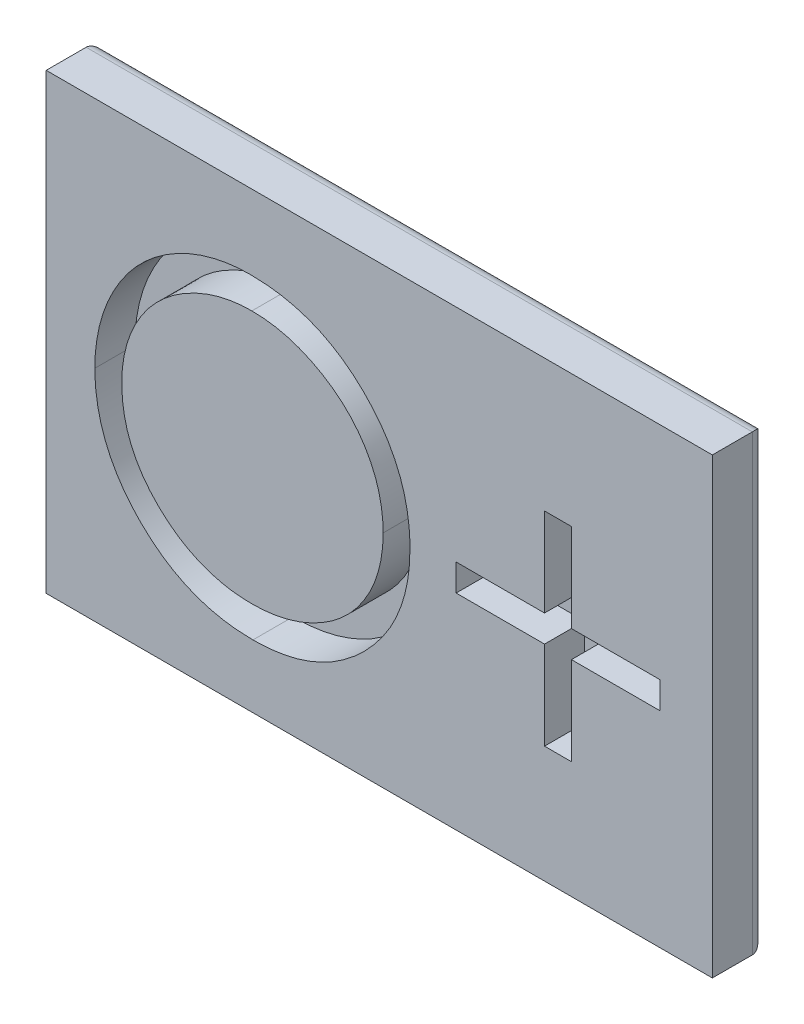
ISO-10303-21;
HEADER;
FILE_DESCRIPTION(('STEP AP214'),'2;1');
FILE_NAME('part.step','',(''),(''),'','','');
FILE_SCHEMA(('AUTOMOTIVE_DESIGN { 1 0 10303 214 1 1 1 1 }'));
ENDSEC;
DATA;
#1=APPLICATION_CONTEXT('core data for automotive mechanical design processes');
#2=APPLICATION_PROTOCOL_DEFINITION('international standard','automotive_design',2000,#1);
#3=PRODUCT_CONTEXT('',#1,'mechanical');
#4=PRODUCT('Part','Part','',(#3));
#5=PRODUCT_RELATED_PRODUCT_CATEGORY('part','',(#4));
#6=PRODUCT_DEFINITION_FORMATION('','',#4);
#7=PRODUCT_DEFINITION_CONTEXT('part definition',#1,'design');
#8=PRODUCT_DEFINITION('design','',#6,#7);
#9=PRODUCT_DEFINITION_SHAPE('','',#8);
#10=(LENGTH_UNIT() NAMED_UNIT(*) SI_UNIT(.MILLI.,.METRE.));
#11=(NAMED_UNIT(*) PLANE_ANGLE_UNIT() SI_UNIT($,.RADIAN.));
#12=(NAMED_UNIT(*) SI_UNIT($,.STERADIAN.) SOLID_ANGLE_UNIT());
#13=UNCERTAINTY_MEASURE_WITH_UNIT(LENGTH_MEASURE(1.E-05),#10,'distance_accuracy_value','');
#14=(GEOMETRIC_REPRESENTATION_CONTEXT(3) GLOBAL_UNCERTAINTY_ASSIGNED_CONTEXT((#13)) GLOBAL_UNIT_ASSIGNED_CONTEXT((#10,
#11,#12)) REPRESENTATION_CONTEXT('',''));
#15=CARTESIAN_POINT('',(0.,0.,0.));
#16=DIRECTION('',(0.,0.,1.));
#17=DIRECTION('',(1.,0.,0.));
#18=AXIS2_PLACEMENT_3D('',#15,#16,#17);
#19=CARTESIAN_POINT('',(0.,0.,2.54));
#20=DIRECTION('',(0.,0.,-1.));
#21=DIRECTION('',(-1.,0.,0.));
#22=AXIS2_PLACEMENT_3D('',#19,#20,#21);
#23=PLANE('',#22);
#24=DIRECTION('',(1.,0.,0.));
#25=VECTOR('',#24,1.);
#26=CARTESIAN_POINT('',(3.66346153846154,0.270538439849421,2.54));
#27=LINE('',#26,#25);
#28=CARTESIAN_POINT('',(3.66346153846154,0.270538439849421,2.54));
#29=VERTEX_POINT('',#28);
#30=CARTESIAN_POINT('',(7.8764423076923,0.270538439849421,2.54));
#31=VERTEX_POINT('',#30);
#32=EDGE_CURVE('E376',#29,#31,#27,.T.);
#33=ORIENTED_EDGE('',*,*,#32,.T.);
#34=DIRECTION('',(0.,1.,0.));
#35=VECTOR('',#34,1.);
#36=CARTESIAN_POINT('',(7.8764423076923,0.270538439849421,2.54));
#37=LINE('',#36,#35);
#38=CARTESIAN_POINT('',(7.8764423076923,4.48351920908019,2.54));
#39=VERTEX_POINT('',#38);
#40=EDGE_CURVE('E380',#31,#39,#37,.T.);
#41=ORIENTED_EDGE('',*,*,#40,.T.);
#42=DIRECTION('',(1.,0.,0.));
#43=VECTOR('',#42,1.);
#44=CARTESIAN_POINT('',(7.8764423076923,4.48351920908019,2.54));
#45=LINE('',#44,#43);
#46=CARTESIAN_POINT('',(9.15865384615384,4.48351920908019,2.54));
#47=VERTEX_POINT('',#46);
#48=EDGE_CURVE('E384',#39,#47,#45,.T.);
#49=ORIENTED_EDGE('',*,*,#48,.T.);
#50=DIRECTION('',(0.,-1.,0.));
#51=VECTOR('',#50,1.);
#52=CARTESIAN_POINT('',(9.15865384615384,4.48351920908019,2.54));
#53=LINE('',#52,#51);
#54=CARTESIAN_POINT('',(9.15865384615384,0.270538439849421,2.54));
#55=VERTEX_POINT('',#54);
#56=EDGE_CURVE('E388',#47,#55,#53,.T.);
#57=ORIENTED_EDGE('',*,*,#56,.T.);
#58=DIRECTION('',(1.,0.,0.));
#59=VECTOR('',#58,1.);
#60=CARTESIAN_POINT('',(9.15865384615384,0.270538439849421,2.54));
#61=LINE('',#60,#59);
#62=CARTESIAN_POINT('',(13.3716346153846,0.270538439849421,2.54));
#63=VERTEX_POINT('',#62);
#64=EDGE_CURVE('E392',#55,#63,#61,.T.);
#65=ORIENTED_EDGE('',*,*,#64,.T.);
#66=DIRECTION('',(0.,-1.,0.));
#67=VECTOR('',#66,1.);
#68=CARTESIAN_POINT('',(13.3716346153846,0.270538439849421,2.54));
#69=LINE('',#68,#67);
#70=CARTESIAN_POINT('',(13.3716346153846,-1.01167309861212,2.54));
#71=VERTEX_POINT('',#70);
#72=EDGE_CURVE('E396',#63,#71,#69,.T.);
#73=ORIENTED_EDGE('',*,*,#72,.T.);
#74=DIRECTION('',(-1.,0.,0.));
#75=VECTOR('',#74,1.);
#76=CARTESIAN_POINT('',(13.3716346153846,-1.01167309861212,2.54));
#77=LINE('',#76,#75);
#78=CARTESIAN_POINT('',(9.15865384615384,-1.01167309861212,2.54));
#79=VERTEX_POINT('',#78);
#80=EDGE_CURVE('E400',#71,#79,#77,.T.);
#81=ORIENTED_EDGE('',*,*,#80,.T.);
#82=DIRECTION('',(0.,-1.,0.));
#83=VECTOR('',#82,1.);
#84=CARTESIAN_POINT('',(9.15865384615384,-1.01167309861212,2.54));
#85=LINE('',#84,#83);
#86=CARTESIAN_POINT('',(9.15865384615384,-5.22465386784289,2.54));
#87=VERTEX_POINT('',#86);
#88=EDGE_CURVE('E404',#79,#87,#85,.T.);
#89=ORIENTED_EDGE('',*,*,#88,.T.);
#90=DIRECTION('',(-1.,0.,0.));
#91=VECTOR('',#90,1.);
#92=CARTESIAN_POINT('',(9.15865384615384,-5.22465386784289,2.54));
#93=LINE('',#92,#91);
#94=CARTESIAN_POINT('',(7.8764423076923,-5.22465386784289,2.54));
#95=VERTEX_POINT('',#94);
#96=EDGE_CURVE('E408',#87,#95,#93,.T.);
#97=ORIENTED_EDGE('',*,*,#96,.T.);
#98=DIRECTION('',(0.,1.,0.));
#99=VECTOR('',#98,1.);
#100=CARTESIAN_POINT('',(7.8764423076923,-5.22465386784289,2.54));
#101=LINE('',#100,#99);
#102=CARTESIAN_POINT('',(7.8764423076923,-1.01167309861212,2.54));
#103=VERTEX_POINT('',#102);
#104=EDGE_CURVE('E412',#95,#103,#101,.T.);
#105=ORIENTED_EDGE('',*,*,#104,.T.);
#106=DIRECTION('',(-1.,0.,0.));
#107=VECTOR('',#106,1.);
#108=CARTESIAN_POINT('',(7.8764423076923,-1.01167309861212,2.54));
#109=LINE('',#108,#107);
#110=CARTESIAN_POINT('',(3.66346153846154,-1.01167309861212,2.54));
#111=VERTEX_POINT('',#110);
#112=EDGE_CURVE('E416',#103,#111,#109,.T.);
#113=ORIENTED_EDGE('',*,*,#112,.T.);
#114=DIRECTION('',(0.,1.,0.));
#115=VECTOR('',#114,1.);
#116=CARTESIAN_POINT('',(3.66346153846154,-1.01167309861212,2.54));
#117=LINE('',#116,#115);
#118=EDGE_CURVE('E342',#111,#29,#117,.T.);
#119=ORIENTED_EDGE('',*,*,#118,.T.);
#120=EDGE_LOOP('',(#33,#41,#49,#57,#65,#73,#81,#89,#97,#105,#113,#119));
#121=FACE_BOUND('',#120,.T.);
#122=DIRECTION('',(0.,1.,0.));
#123=VECTOR('',#122,1.);
#124=CARTESIAN_POINT('',(15.875,-10.795,2.54));
#125=LINE('',#124,#123);
#126=CARTESIAN_POINT('',(15.875,-10.795,2.54));
#127=VERTEX_POINT('',#126);
#128=CARTESIAN_POINT('',(15.875,10.795,2.54));
#129=VERTEX_POINT('',#128);
#130=EDGE_CURVE('E461',#127,#129,#125,.T.);
#131=ORIENTED_EDGE('',*,*,#130,.T.);
#132=DIRECTION('',(-1.,0.,0.));
#133=VECTOR('',#132,1.);
#134=CARTESIAN_POINT('',(-15.875,10.795,2.54));
#135=LINE('',#134,#133);
#136=CARTESIAN_POINT('',(-15.875,10.795,2.54));
#137=VERTEX_POINT('',#136);
#138=EDGE_CURVE('E465',#129,#137,#135,.T.);
#139=ORIENTED_EDGE('',*,*,#138,.T.);
#140=DIRECTION('',(0.,-1.,0.));
#141=VECTOR('',#140,1.);
#142=CARTESIAN_POINT('',(-15.875,-10.795,2.54));
#143=LINE('',#142,#141);
#144=CARTESIAN_POINT('',(-15.875,-10.795,2.54));
#145=VERTEX_POINT('',#144);
#146=EDGE_CURVE('E468',#137,#145,#143,.T.);
#147=ORIENTED_EDGE('',*,*,#146,.T.);
#148=DIRECTION('',(1.,0.,0.));
#149=VECTOR('',#148,1.);
#150=CARTESIAN_POINT('',(-15.875,-10.795,2.54));
#151=LINE('',#150,#149);
#152=EDGE_CURVE('E471',#145,#127,#151,.T.);
#153=ORIENTED_EDGE('',*,*,#152,.T.);
#154=EDGE_LOOP('',(#131,#139,#147,#153));
#155=FACE_BOUND('',#154,.T.);
#156=CARTESIAN_POINT('',(-13.5548076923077,-0.341946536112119,2.54));
#157=CARTESIAN_POINT('',(-13.5526252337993,-0.171996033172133,2.54));
#158=CARTESIAN_POINT('',(-13.5482878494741,0.165760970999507,2.54));
#159=CARTESIAN_POINT('',(-13.4960703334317,0.667319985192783,2.54));
#160=CARTESIAN_POINT('',(-13.4202988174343,1.16081292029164,2.54));
#161=CARTESIAN_POINT('',(-13.3117060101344,1.64483646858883,2.54));
#162=CARTESIAN_POINT('',(-13.1696814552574,2.11820577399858,2.54));
#163=CARTESIAN_POINT('',(-13.002101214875,2.58418549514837,2.54));
#164=CARTESIAN_POINT('',(-12.7974232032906,3.03805333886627,2.54));
#165=CARTESIAN_POINT('',(-12.5660447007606,3.48195939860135,2.54));
#166=CARTESIAN_POINT('',(-12.3078009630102,3.90898381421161,2.54));
#167=CARTESIAN_POINT('',(-12.0225581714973,4.31262439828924,2.54));
#168=CARTESIAN_POINT('',(-11.7203352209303,4.69626825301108,2.54));
#169=CARTESIAN_POINT('',(-11.3890146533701,5.04997370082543,2.54));
#170=CARTESIAN_POINT('',(-11.0395160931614,5.38403037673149,2.54));
#171=CARTESIAN_POINT('',(-10.6661699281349,5.69330461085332,2.54));
#172=CARTESIAN_POINT('',(-10.2712542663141,5.98058521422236,2.54));
#173=CARTESIAN_POINT('',(-9.85306983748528,6.23947610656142,2.54));
#174=CARTESIAN_POINT('',(-9.42192095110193,6.47362428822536,2.54));
#175=CARTESIAN_POINT('',(-8.97747039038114,6.67455491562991,2.54));
#176=CARTESIAN_POINT('',(-8.52575445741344,6.84700937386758,2.54));
#177=CARTESIAN_POINT('',(-8.06465744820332,6.98678531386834,2.54));
#178=CARTESIAN_POINT('',(-7.59540381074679,7.09713394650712,2.54));
#179=CARTESIAN_POINT('',(-7.11696938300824,7.1722753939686,2.54));
#180=CARTESIAN_POINT('',(-6.62973531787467,7.22462609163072,2.54));
#181=CARTESIAN_POINT('',(-6.30148482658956,7.22894296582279,2.54));
#182=CARTESIAN_POINT('',(-6.13629807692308,7.23111536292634,2.54));
#183=B_SPLINE_CURVE_WITH_KNOTS('',3,(#156,#157,#158,#159,#160,#161,#162,#163,#164,#165,#166,
#167,#168,#169,#170,#171,#172,#173,#174,#175,#176,#177,#178,#179,#180,#181,#182),.UNSPECIFIED.,
.F.,.F.,(4,1,1,1,1,1,1,1,1,1,1,1,1,1,1,1,1,1,1,1,1,1,1,1,4),(0.,0.0432089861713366,
0.0858728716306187,0.128120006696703,0.170151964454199,0.211917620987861,0.253753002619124,
0.29600640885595,0.338443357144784,0.381015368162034,0.422820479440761,0.464089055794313,
0.505125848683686,0.545974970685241,0.58698521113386,0.628338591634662,0.670083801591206,
0.711991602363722,0.753039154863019,0.794049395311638,0.834885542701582,0.875498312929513,
0.916547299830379,0.958003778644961,1.),.UNSPECIFIED.);
#184=CARTESIAN_POINT('',(-13.5548076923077,-0.341946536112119,2.54));
#185=VERTEX_POINT('',#184);
#186=CARTESIAN_POINT('',(-6.13629807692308,7.23111536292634,2.54));
#187=VERTEX_POINT('',#186);
#188=EDGE_CURVE('E56',#185,#187,#183,.T.);
#189=ORIENTED_EDGE('',*,*,#188,.T.);
#190=CARTESIAN_POINT('',(-6.13629807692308,7.23111536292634,2.54));
#191=CARTESIAN_POINT('',(-5.87174213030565,7.2244146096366,2.54));
#192=CARTESIAN_POINT('',(-5.35213242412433,7.21125377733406,2.54));
#193=CARTESIAN_POINT('',(-4.58846596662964,7.11051015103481,2.54));
#194=CARTESIAN_POINT('',(-3.859415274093,6.93622146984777,2.54));
#195=CARTESIAN_POINT('',(-3.15904145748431,6.70409865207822,2.54));
#196=CARTESIAN_POINT('',(-2.49572191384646,6.39445021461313,2.54));
#197=CARTESIAN_POINT('',(-1.86446386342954,6.02017834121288,2.54));
#198=CARTESIAN_POINT('',(-1.2667692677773,5.57736193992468,2.54));
#199=CARTESIAN_POINT('',(-0.710694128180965,5.0694240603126,2.54));
#200=CARTESIAN_POINT('',(-0.201826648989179,4.51676946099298,2.54));
#201=CARTESIAN_POINT('',(0.246498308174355,3.92698999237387,2.54));
#202=CARTESIAN_POINT('',(0.622228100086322,3.30365166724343,2.54));
#203=CARTESIAN_POINT('',(0.930780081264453,2.64862763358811,2.54));
#204=CARTESIAN_POINT('',(1.17284547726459,1.96339926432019,2.54));
#205=CARTESIAN_POINT('',(1.33988285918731,1.24431346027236,2.54));
#206=CARTESIAN_POINT('',(1.44658252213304,0.496029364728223,2.54));
#207=CARTESIAN_POINT('',(1.4590566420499,-0.0143481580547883,2.54));
#208=CARTESIAN_POINT('',(1.46538461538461,-0.273256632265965,2.54));
#209=B_SPLINE_CURVE_WITH_KNOTS('',3,(#190,#191,#192,#193,#194,#195,#196,#197,#198,#199,#200,
#201,#202,#203,#204,#205,#206,#207,#208),.UNSPECIFIED.,.F.,.F.,(4,1,1,1,1,1,1,1,1,1,1,1,1,1,1,1,
4),(0.,0.0665700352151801,0.130749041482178,0.193412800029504,0.254989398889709,0.3161135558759,
0.377261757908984,0.439400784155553,0.502970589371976,0.566524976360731,0.628231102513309,
0.689090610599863,0.749344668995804,0.810169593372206,0.871609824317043,0.934869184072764,1.),.UNSPECIFIED.);
#210=CARTESIAN_POINT('',(1.46538461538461,-0.273256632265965,2.54));
#211=VERTEX_POINT('',#210);
#212=EDGE_CURVE('E294',#187,#211,#209,.T.);
#213=ORIENTED_EDGE('',*,*,#212,.T.);
#214=CARTESIAN_POINT('',(1.46538461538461,-0.273256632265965,2.54));
#215=CARTESIAN_POINT('',(1.45905756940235,-0.530257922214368,2.54));
#216=CARTESIAN_POINT('',(1.44658622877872,-1.03683723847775,2.54));
#217=CARTESIAN_POINT('',(1.33976154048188,-1.78037279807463,2.54));
#218=CARTESIAN_POINT('',(1.17222631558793,-2.49511803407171,2.54));
#219=CARTESIAN_POINT('',(0.93302798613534,-3.17987975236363,2.54));
#220=CARTESIAN_POINT('',(0.625946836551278,-3.83538030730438,2.54));
#221=CARTESIAN_POINT('',(0.247715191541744,-4.45989490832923,2.54));
#222=CARTESIAN_POINT('',(-0.197814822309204,-5.05362829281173,2.54));
#223=CARTESIAN_POINT('',(-0.704844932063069,-5.61007606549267,2.54));
#224=CARTESIAN_POINT('',(-1.25757132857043,-6.12033359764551,2.54));
#225=CARTESIAN_POINT('',(-1.85042202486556,-6.56495600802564,2.54));
#226=CARTESIAN_POINT('',(-2.47006404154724,-6.94755127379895,2.54));
#227=CARTESIAN_POINT('',(-3.12447117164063,-7.25282891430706,2.54));
#228=CARTESIAN_POINT('',(-3.80496453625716,-7.49682643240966,2.54));
#229=CARTESIAN_POINT('',(-4.51763451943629,-7.66318449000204,2.54));
#230=CARTESIAN_POINT('',(-5.25914170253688,-7.77049195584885,2.54));
#231=CARTESIAN_POINT('',(-5.7648008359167,-7.78281396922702,2.54));
#232=CARTESIAN_POINT('',(-6.02181490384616,-7.78907694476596,2.54));
#233=B_SPLINE_CURVE_WITH_KNOTS('',3,(#214,#215,#216,#217,#218,#219,#220,#221,#222,#223,#224,
#225,#226,#227,#228,#229,#230,#231,#232),.UNSPECIFIED.,.F.,.F.,(4,1,1,1,1,1,1,1,1,1,1,1,1,1,1,1,
4),(0.,0.0652265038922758,0.128568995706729,0.190320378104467,0.251377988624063,
0.312387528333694,0.373788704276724,0.43643115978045,0.500566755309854,0.564686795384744,
0.627135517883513,0.68845540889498,0.749245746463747,0.810155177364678,0.871670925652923,
0.934773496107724,1.),.UNSPECIFIED.);
#234=CARTESIAN_POINT('',(-6.02181490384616,-7.78907694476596,2.54));
#235=VERTEX_POINT('',#234);
#236=EDGE_CURVE('E303',#211,#235,#233,.T.);
#237=ORIENTED_EDGE('',*,*,#236,.T.);
#238=CARTESIAN_POINT('',(-6.02181490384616,-7.78907694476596,2.54));
#239=CARTESIAN_POINT('',(-6.2807220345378,-7.78275212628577,2.54));
#240=CARTESIAN_POINT('',(-6.79109690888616,-7.77028422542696,2.54));
#241=CARTESIAN_POINT('',(-7.54032130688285,-7.66340799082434,2.54));
#242=CARTESIAN_POINT('',(-8.2599122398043,-7.4962797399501,2.54));
#243=CARTESIAN_POINT('',(-8.94781189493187,-7.25743586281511,2.54));
#244=CARTESIAN_POINT('',(-9.60440387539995,-6.94875552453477,2.54));
#245=CARTESIAN_POINT('',(-10.2309723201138,-6.57236407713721,2.54));
#246=CARTESIAN_POINT('',(-10.8250022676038,-6.1257484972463,2.54));
#247=CARTESIAN_POINT('',(-11.381568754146,-5.61888280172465,2.54));
#248=CARTESIAN_POINT('',(-11.8908128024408,-5.06709321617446,2.54));
#249=CARTESIAN_POINT('',(-12.3347841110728,-4.4758590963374,2.54));
#250=CARTESIAN_POINT('',(-12.711260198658,-3.85677985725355,2.54));
#251=CARTESIAN_POINT('',(-13.018904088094,-3.20813746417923,2.54));
#252=CARTESIAN_POINT('',(-13.2624629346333,-2.53306761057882,2.54));
#253=CARTESIAN_POINT('',(-13.4286258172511,-1.82706721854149,2.54));
#254=CARTESIAN_POINT('',(-13.536132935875,-1.09416130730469,2.54));
#255=CARTESIAN_POINT('',(-13.5485216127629,-0.595148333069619,2.54));
#256=CARTESIAN_POINT('',(-13.5548076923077,-0.341946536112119,2.54));
#257=B_SPLINE_CURVE_WITH_KNOTS('',3,(#238,#239,#240,#241,#242,#243,#244,#245,#246,#247,#248,
#249,#250,#251,#252,#253,#254,#255,#256),.UNSPECIFIED.,.F.,.F.,(4,1,1,1,1,1,1,1,1,1,1,1,1,1,1,1,
4),(0.,0.0658188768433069,0.129746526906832,0.192071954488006,0.253459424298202,
0.31456958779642,0.376279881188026,0.43902565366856,0.503267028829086,0.567492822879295,
0.629704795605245,0.690999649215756,0.751451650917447,0.812004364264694,0.873149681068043,
0.935635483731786,1.),.UNSPECIFIED.);
#258=EDGE_CURVE('E312',#235,#185,#257,.T.);
#259=ORIENTED_EDGE('',*,*,#258,.T.);
#260=EDGE_LOOP('',(#189,#213,#237,#259));
#261=FACE_BOUND('',#260,.T.);
#262=ADVANCED_FACE('F38',(#121,#155,#261),#23,.F.);
#263=CARTESIAN_POINT('',(15.875,-10.795,2.54));
#264=DIRECTION('',(-1.,0.,0.));
#265=DIRECTION('',(0.,0.,1.));
#266=AXIS2_PLACEMENT_3D('',#263,#264,#265);
#267=PLANE('',#266);
#268=DIRECTION('',(0.,0.,-1.));
#269=VECTOR('',#268,1.);
#270=CARTESIAN_POINT('',(15.875,-10.795,2.54));
#271=LINE('',#270,#269);
#272=CARTESIAN_POINT('',(15.875,-10.795,0.635));
#273=VERTEX_POINT('',#272);
#274=EDGE_CURVE('E474',#127,#273,#271,.T.);
#275=ORIENTED_EDGE('',*,*,#274,.T.);
#276=DIRECTION('',(0.,1.,0.));
#277=VECTOR('',#276,1.);
#278=CARTESIAN_POINT('',(15.875,10.795,0.635));
#279=LINE('',#278,#277);
#280=CARTESIAN_POINT('',(15.875,10.795,0.635));
#281=VERTEX_POINT('',#280);
#282=EDGE_CURVE('E11',#273,#281,#279,.T.);
#283=ORIENTED_EDGE('',*,*,#282,.T.);
#284=DIRECTION('',(0.,0.,-1.));
#285=VECTOR('',#284,1.);
#286=CARTESIAN_POINT('',(15.875,10.795,2.54));
#287=LINE('',#286,#285);
#288=EDGE_CURVE('E486',#129,#281,#287,.T.);
#289=ORIENTED_EDGE('',*,*,#288,.F.);
#290=ORIENTED_EDGE('',*,*,#130,.F.);
#291=EDGE_LOOP('',(#275,#283,#289,#290));
#292=FACE_BOUND('',#291,.T.);
#293=ADVANCED_FACE('F558',(#292),#267,.F.);
#294=CARTESIAN_POINT('',(-15.875,10.795,2.54));
#295=DIRECTION('',(0.,-1.,0.));
#296=DIRECTION('',(0.,0.,-1.));
#297=AXIS2_PLACEMENT_3D('',#294,#295,#296);
#298=PLANE('',#297);
#299=ORIENTED_EDGE('',*,*,#288,.T.);
#300=DIRECTION('',(-1.,0.,0.));
#301=VECTOR('',#300,1.);
#302=CARTESIAN_POINT('',(-15.875,10.795,0.635));
#303=LINE('',#302,#301);
#304=CARTESIAN_POINT('',(-15.875,10.795,0.635));
#305=VERTEX_POINT('',#304);
#306=EDGE_CURVE('E48',#281,#305,#303,.T.);
#307=ORIENTED_EDGE('',*,*,#306,.T.);
#308=DIRECTION('',(0.,0.,-1.));
#309=VECTOR('',#308,1.);
#310=CARTESIAN_POINT('',(-15.875,10.795,2.54));
#311=LINE('',#310,#309);
#312=EDGE_CURVE('E482',#137,#305,#311,.T.);
#313=ORIENTED_EDGE('',*,*,#312,.F.);
#314=ORIENTED_EDGE('',*,*,#138,.F.);
#315=EDGE_LOOP('',(#299,#307,#313,#314));
#316=FACE_BOUND('',#315,.T.);
#317=ADVANCED_FACE('F556',(#316),#298,.F.);
#318=CARTESIAN_POINT('',(-15.875,-10.795,2.54));
#319=DIRECTION('',(1.,0.,0.));
#320=DIRECTION('',(0.,0.,-1.));
#321=AXIS2_PLACEMENT_3D('',#318,#319,#320);
#322=PLANE('',#321);
#323=ORIENTED_EDGE('',*,*,#312,.T.);
#324=DIRECTION('',(0.,-1.,0.));
#325=VECTOR('',#324,1.);
#326=CARTESIAN_POINT('',(-15.875,-10.795,0.635));
#327=LINE('',#326,#325);
#328=CARTESIAN_POINT('',(-15.875,-10.795,0.635));
#329=VERTEX_POINT('',#328);
#330=EDGE_CURVE('E490',#305,#329,#327,.T.);
#331=ORIENTED_EDGE('',*,*,#330,.T.);
#332=DIRECTION('',(0.,0.,-1.));
#333=VECTOR('',#332,1.);
#334=CARTESIAN_POINT('',(-15.875,-10.795,2.54));
#335=LINE('',#334,#333);
#336=EDGE_CURVE('E478',#145,#329,#335,.T.);
#337=ORIENTED_EDGE('',*,*,#336,.F.);
#338=ORIENTED_EDGE('',*,*,#146,.F.);
#339=EDGE_LOOP('',(#323,#331,#337,#338));
#340=FACE_BOUND('',#339,.T.);
#341=ADVANCED_FACE('F546',(#340),#322,.F.);
#342=CARTESIAN_POINT('',(-15.875,-10.795,2.54));
#343=DIRECTION('',(0.,1.,0.));
#344=DIRECTION('',(0.,0.,1.));
#345=AXIS2_PLACEMENT_3D('',#342,#343,#344);
#346=PLANE('',#345);
#347=ORIENTED_EDGE('',*,*,#336,.T.);
#348=DIRECTION('',(1.,0.,0.));
#349=VECTOR('',#348,1.);
#350=CARTESIAN_POINT('',(15.875,-10.795,0.635));
#351=LINE('',#350,#349);
#352=EDGE_CURVE('E507',#329,#273,#351,.T.);
#353=ORIENTED_EDGE('',*,*,#352,.T.);
#354=ORIENTED_EDGE('',*,*,#274,.F.);
#355=ORIENTED_EDGE('',*,*,#152,.F.);
#356=EDGE_LOOP('',(#347,#353,#354,#355));
#357=FACE_BOUND('',#356,.T.);
#358=ADVANCED_FACE('F550',(#357),#346,.F.);
#359=CARTESIAN_POINT('',(0.,0.,0.));
#360=DIRECTION('',(0.,0.,-1.));
#361=DIRECTION('',(-1.,0.,0.));
#362=AXIS2_PLACEMENT_3D('',#359,#360,#361);
#363=PLANE('',#362);
#364=DIRECTION('',(1.,0.,0.));
#365=VECTOR('',#364,1.);
#366=CARTESIAN_POINT('',(-15.875,-10.16,0.));
#367=LINE('',#366,#365);
#368=CARTESIAN_POINT('',(15.24,-10.16,0.));
#369=VERTEX_POINT('',#368);
#370=CARTESIAN_POINT('',(-15.24,-10.16,0.));
#371=VERTEX_POINT('',#370);
#372=EDGE_CURVE('E500',#369,#371,#367,.F.);
#373=ORIENTED_EDGE('',*,*,#372,.T.);
#374=DIRECTION('',(0.,-1.,0.));
#375=VECTOR('',#374,1.);
#376=CARTESIAN_POINT('',(-15.24,10.795,0.));
#377=LINE('',#376,#375);
#378=CARTESIAN_POINT('',(-15.24,10.16,0.));
#379=VERTEX_POINT('',#378);
#380=EDGE_CURVE('E503',#371,#379,#377,.F.);
#381=ORIENTED_EDGE('',*,*,#380,.T.);
#382=DIRECTION('',(-1.,0.,0.));
#383=VECTOR('',#382,1.);
#384=CARTESIAN_POINT('',(15.875,10.16,0.));
#385=LINE('',#384,#383);
#386=CARTESIAN_POINT('',(15.24,10.16,0.));
#387=VERTEX_POINT('',#386);
#388=EDGE_CURVE('E497',#379,#387,#385,.F.);
#389=ORIENTED_EDGE('',*,*,#388,.T.);
#390=DIRECTION('',(0.,1.,0.));
#391=VECTOR('',#390,1.);
#392=CARTESIAN_POINT('',(15.24,-10.795,0.));
#393=LINE('',#392,#391);
#394=EDGE_CURVE('E494',#387,#369,#393,.F.);
#395=ORIENTED_EDGE('',*,*,#394,.T.);
#396=EDGE_LOOP('',(#373,#381,#389,#395));
#397=FACE_BOUND('',#396,.T.);
#398=ADVANCED_FACE('F535',(#397),#363,.T.);
#399=CARTESIAN_POINT('',(15.24,-10.795,0.635));
#400=DIRECTION('',(0.,-1.,0.));
#401=DIRECTION('',(0.,0.,-1.));
#402=AXIS2_PLACEMENT_3D('',#399,#400,#401);
#403=CYLINDRICAL_SURFACE('',#402,0.635);
#404=CARTESIAN_POINT('',(15.24,-10.16,0.635));
#405=DIRECTION('',(-0.707106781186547,-0.707106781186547,0.));
#406=DIRECTION('',(0.707106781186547,-0.707106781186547,0.));
#407=AXIS2_PLACEMENT_3D('',#404,#405,#406);
#408=ELLIPSE('',#407,0.898025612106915,0.635);
#409=EDGE_CURVE('E516',#369,#273,#408,.T.);
#410=ORIENTED_EDGE('',*,*,#409,.F.);
#411=ORIENTED_EDGE('',*,*,#394,.F.);
#412=CARTESIAN_POINT('',(15.24,10.16,0.635));
#413=DIRECTION('',(0.707106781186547,-0.707106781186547,0.));
#414=DIRECTION('',(-0.707106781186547,-0.707106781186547,0.));
#415=AXIS2_PLACEMENT_3D('',#412,#413,#414);
#416=ELLIPSE('',#415,0.898025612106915,0.635);
#417=EDGE_CURVE('E42',#281,#387,#416,.F.);
#418=ORIENTED_EDGE('',*,*,#417,.F.);
#419=ORIENTED_EDGE('',*,*,#282,.F.);
#420=EDGE_LOOP('',(#410,#411,#418,#419));
#421=FACE_BOUND('',#420,.T.);
#422=ADVANCED_FACE('F40',(#421),#403,.T.);
#423=CARTESIAN_POINT('',(-15.875,10.16,0.635));
#424=DIRECTION('',(1.,0.,0.));
#425=DIRECTION('',(0.,0.,-1.));
#426=AXIS2_PLACEMENT_3D('',#423,#424,#425);
#427=CYLINDRICAL_SURFACE('',#426,0.635);
#428=ORIENTED_EDGE('',*,*,#417,.T.);
#429=ORIENTED_EDGE('',*,*,#388,.F.);
#430=CARTESIAN_POINT('',(-15.24,10.16,0.635));
#431=DIRECTION('',(0.707106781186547,0.707106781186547,0.));
#432=DIRECTION('',(0.707106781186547,-0.707106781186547,0.));
#433=AXIS2_PLACEMENT_3D('',#430,#431,#432);
#434=ELLIPSE('',#433,0.898025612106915,0.635);
#435=EDGE_CURVE('E514',#305,#379,#434,.F.);
#436=ORIENTED_EDGE('',*,*,#435,.F.);
#437=ORIENTED_EDGE('',*,*,#306,.F.);
#438=EDGE_LOOP('',(#428,#429,#436,#437));
#439=FACE_BOUND('',#438,.T.);
#440=ADVANCED_FACE('F529',(#439),#427,.T.);
#441=CARTESIAN_POINT('',(-15.875,-10.16,0.635));
#442=DIRECTION('',(-1.,0.,0.));
#443=DIRECTION('',(0.,0.,1.));
#444=AXIS2_PLACEMENT_3D('',#441,#442,#443);
#445=CYLINDRICAL_SURFACE('',#444,0.635);
#446=ORIENTED_EDGE('',*,*,#409,.T.);
#447=ORIENTED_EDGE('',*,*,#352,.F.);
#448=CARTESIAN_POINT('',(-15.24,-10.16,0.635));
#449=DIRECTION('',(-0.707106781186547,0.707106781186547,0.));
#450=DIRECTION('',(-0.707106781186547,-0.707106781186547,0.));
#451=AXIS2_PLACEMENT_3D('',#448,#449,#450);
#452=ELLIPSE('',#451,0.898025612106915,0.635);
#453=EDGE_CURVE('E336',#371,#329,#452,.T.);
#454=ORIENTED_EDGE('',*,*,#453,.F.);
#455=ORIENTED_EDGE('',*,*,#372,.F.);
#456=EDGE_LOOP('',(#446,#447,#454,#455));
#457=FACE_BOUND('',#456,.T.);
#458=ADVANCED_FACE('F541',(#457),#445,.T.);
#459=CARTESIAN_POINT('',(-15.24,-10.795,0.635));
#460=DIRECTION('',(0.,1.,0.));
#461=DIRECTION('',(0.,0.,1.));
#462=AXIS2_PLACEMENT_3D('',#459,#460,#461);
#463=CYLINDRICAL_SURFACE('',#462,0.635);
#464=ORIENTED_EDGE('',*,*,#435,.T.);
#465=ORIENTED_EDGE('',*,*,#380,.F.);
#466=ORIENTED_EDGE('',*,*,#453,.T.);
#467=ORIENTED_EDGE('',*,*,#330,.F.);
#468=EDGE_LOOP('',(#464,#465,#466,#467));
#469=FACE_BOUND('',#468,.T.);
#470=ADVANCED_FACE('F539',(#469),#463,.T.);
#471=CARTESIAN_POINT('',(3.66346153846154,0.270538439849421,0.635));
#472=DIRECTION('',(0.,-1.,0.));
#473=DIRECTION('',(0.,0.,-1.));
#474=AXIS2_PLACEMENT_3D('',#471,#472,#473);
#475=PLANE('',#474);
#476=ORIENTED_EDGE('',*,*,#32,.F.);
#477=DIRECTION('',(0.,0.,1.));
#478=VECTOR('',#477,1.);
#479=CARTESIAN_POINT('',(3.66346153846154,0.270538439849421,0.635));
#480=LINE('',#479,#478);
#481=CARTESIAN_POINT('',(3.66346153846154,0.270538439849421,0.635));
#482=VERTEX_POINT('',#481);
#483=EDGE_CURVE('E375',#482,#29,#480,.T.);
#484=ORIENTED_EDGE('',*,*,#483,.F.);
#485=DIRECTION('',(1.,0.,0.));
#486=VECTOR('',#485,1.);
#487=CARTESIAN_POINT('',(3.66346153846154,0.270538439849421,0.635));
#488=LINE('',#487,#486);
#489=CARTESIAN_POINT('',(7.8764423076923,0.270538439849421,0.635));
#490=VERTEX_POINT('',#489);
#491=EDGE_CURVE('E337',#482,#490,#488,.T.);
#492=ORIENTED_EDGE('',*,*,#491,.T.);
#493=DIRECTION('',(0.,0.,1.));
#494=VECTOR('',#493,1.);
#495=CARTESIAN_POINT('',(7.8764423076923,0.270538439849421,0.635));
#496=LINE('',#495,#494);
#497=EDGE_CURVE('E456',#490,#31,#496,.T.);
#498=ORIENTED_EDGE('',*,*,#497,.T.);
#499=EDGE_LOOP('',(#476,#484,#492,#498));
#500=FACE_BOUND('',#499,.T.);
#501=ADVANCED_FACE('F573',(#500),#475,.T.);
#502=CARTESIAN_POINT('',(7.8764423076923,0.270538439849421,0.635));
#503=DIRECTION('',(1.,0.,0.));
#504=DIRECTION('',(0.,0.,-1.));
#505=AXIS2_PLACEMENT_3D('',#502,#503,#504);
#506=PLANE('',#505);
#507=ORIENTED_EDGE('',*,*,#40,.F.);
#508=ORIENTED_EDGE('',*,*,#497,.F.);
#509=DIRECTION('',(0.,1.,0.));
#510=VECTOR('',#509,1.);
#511=CARTESIAN_POINT('',(7.8764423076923,0.270538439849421,0.635));
#512=LINE('',#511,#510);
#513=CARTESIAN_POINT('',(7.8764423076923,4.48351920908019,0.635));
#514=VERTEX_POINT('',#513);
#515=EDGE_CURVE('E341',#490,#514,#512,.T.);
#516=ORIENTED_EDGE('',*,*,#515,.T.);
#517=DIRECTION('',(0.,0.,1.));
#518=VECTOR('',#517,1.);
#519=CARTESIAN_POINT('',(7.8764423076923,4.48351920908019,0.635));
#520=LINE('',#519,#518);
#521=EDGE_CURVE('E453',#514,#39,#520,.T.);
#522=ORIENTED_EDGE('',*,*,#521,.T.);
#523=EDGE_LOOP('',(#507,#508,#516,#522));
#524=FACE_BOUND('',#523,.T.);
#525=ADVANCED_FACE('F636',(#524),#506,.T.);
#526=CARTESIAN_POINT('',(7.8764423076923,4.48351920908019,0.635));
#527=DIRECTION('',(0.,-1.,0.));
#528=DIRECTION('',(0.,0.,-1.));
#529=AXIS2_PLACEMENT_3D('',#526,#527,#528);
#530=PLANE('',#529);
#531=ORIENTED_EDGE('',*,*,#48,.F.);
#532=ORIENTED_EDGE('',*,*,#521,.F.);
#533=DIRECTION('',(1.,0.,0.));
#534=VECTOR('',#533,1.);
#535=CARTESIAN_POINT('',(7.8764423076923,4.48351920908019,0.635));
#536=LINE('',#535,#534);
#537=CARTESIAN_POINT('',(9.15865384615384,4.48351920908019,0.635));
#538=VERTEX_POINT('',#537);
#539=EDGE_CURVE('E345',#514,#538,#536,.T.);
#540=ORIENTED_EDGE('',*,*,#539,.T.);
#541=DIRECTION('',(0.,0.,1.));
#542=VECTOR('',#541,1.);
#543=CARTESIAN_POINT('',(9.15865384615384,4.48351920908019,0.635));
#544=LINE('',#543,#542);
#545=EDGE_CURVE('E450',#538,#47,#544,.T.);
#546=ORIENTED_EDGE('',*,*,#545,.T.);
#547=EDGE_LOOP('',(#531,#532,#540,#546));
#548=FACE_BOUND('',#547,.T.);
#549=ADVANCED_FACE('F645',(#548),#530,.T.);
#550=CARTESIAN_POINT('',(9.15865384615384,4.48351920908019,0.635));
#551=DIRECTION('',(-1.,0.,0.));
#552=DIRECTION('',(0.,0.,1.));
#553=AXIS2_PLACEMENT_3D('',#550,#551,#552);
#554=PLANE('',#553);
#555=ORIENTED_EDGE('',*,*,#56,.F.);
#556=ORIENTED_EDGE('',*,*,#545,.F.);
#557=DIRECTION('',(0.,-1.,0.));
#558=VECTOR('',#557,1.);
#559=CARTESIAN_POINT('',(9.15865384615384,4.48351920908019,0.635));
#560=LINE('',#559,#558);
#561=CARTESIAN_POINT('',(9.15865384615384,0.270538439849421,0.635));
#562=VERTEX_POINT('',#561);
#563=EDGE_CURVE('E348',#538,#562,#560,.T.);
#564=ORIENTED_EDGE('',*,*,#563,.T.);
#565=DIRECTION('',(0.,0.,1.));
#566=VECTOR('',#565,1.);
#567=CARTESIAN_POINT('',(9.15865384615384,0.270538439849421,0.635));
#568=LINE('',#567,#566);
#569=EDGE_CURVE('E447',#562,#55,#568,.T.);
#570=ORIENTED_EDGE('',*,*,#569,.T.);
#571=EDGE_LOOP('',(#555,#556,#564,#570));
#572=FACE_BOUND('',#571,.T.);
#573=ADVANCED_FACE('F655',(#572),#554,.T.);
#574=CARTESIAN_POINT('',(9.15865384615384,0.270538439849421,0.635));
#575=DIRECTION('',(0.,-1.,0.));
#576=DIRECTION('',(0.,0.,-1.));
#577=AXIS2_PLACEMENT_3D('',#574,#575,#576);
#578=PLANE('',#577);
#579=ORIENTED_EDGE('',*,*,#64,.F.);
#580=ORIENTED_EDGE('',*,*,#569,.F.);
#581=DIRECTION('',(1.,0.,0.));
#582=VECTOR('',#581,1.);
#583=CARTESIAN_POINT('',(9.15865384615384,0.270538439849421,0.635));
#584=LINE('',#583,#582);
#585=CARTESIAN_POINT('',(13.3716346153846,0.270538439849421,0.635));
#586=VERTEX_POINT('',#585);
#587=EDGE_CURVE('E351',#562,#586,#584,.T.);
#588=ORIENTED_EDGE('',*,*,#587,.T.);
#589=DIRECTION('',(0.,0.,1.));
#590=VECTOR('',#589,1.);
#591=CARTESIAN_POINT('',(13.3716346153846,0.270538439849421,0.635));
#592=LINE('',#591,#590);
#593=EDGE_CURVE('E444',#586,#63,#592,.T.);
#594=ORIENTED_EDGE('',*,*,#593,.T.);
#595=EDGE_LOOP('',(#579,#580,#588,#594));
#596=FACE_BOUND('',#595,.T.);
#597=ADVANCED_FACE('F665',(#596),#578,.T.);
#598=CARTESIAN_POINT('',(13.3716346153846,0.270538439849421,0.635));
#599=DIRECTION('',(-1.,0.,0.));
#600=DIRECTION('',(0.,0.,1.));
#601=AXIS2_PLACEMENT_3D('',#598,#599,#600);
#602=PLANE('',#601);
#603=ORIENTED_EDGE('',*,*,#72,.F.);
#604=ORIENTED_EDGE('',*,*,#593,.F.);
#605=DIRECTION('',(0.,-1.,0.));
#606=VECTOR('',#605,1.);
#607=CARTESIAN_POINT('',(13.3716346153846,0.270538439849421,0.635));
#608=LINE('',#607,#606);
#609=CARTESIAN_POINT('',(13.3716346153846,-1.01167309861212,0.635));
#610=VERTEX_POINT('',#609);
#611=EDGE_CURVE('E354',#586,#610,#608,.T.);
#612=ORIENTED_EDGE('',*,*,#611,.T.);
#613=DIRECTION('',(0.,0.,1.));
#614=VECTOR('',#613,1.);
#615=CARTESIAN_POINT('',(13.3716346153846,-1.01167309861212,0.635));
#616=LINE('',#615,#614);
#617=EDGE_CURVE('E441',#610,#71,#616,.T.);
#618=ORIENTED_EDGE('',*,*,#617,.T.);
#619=EDGE_LOOP('',(#603,#604,#612,#618));
#620=FACE_BOUND('',#619,.T.);
#621=ADVANCED_FACE('F675',(#620),#602,.T.);
#622=CARTESIAN_POINT('',(13.3716346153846,-1.01167309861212,0.635));
#623=DIRECTION('',(0.,1.,0.));
#624=DIRECTION('',(0.,0.,1.));
#625=AXIS2_PLACEMENT_3D('',#622,#623,#624);
#626=PLANE('',#625);
#627=ORIENTED_EDGE('',*,*,#80,.F.);
#628=ORIENTED_EDGE('',*,*,#617,.F.);
#629=DIRECTION('',(-1.,0.,0.));
#630=VECTOR('',#629,1.);
#631=CARTESIAN_POINT('',(13.3716346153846,-1.01167309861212,0.635));
#632=LINE('',#631,#630);
#633=CARTESIAN_POINT('',(9.15865384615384,-1.01167309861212,0.635));
#634=VERTEX_POINT('',#633);
#635=EDGE_CURVE('E357',#610,#634,#632,.T.);
#636=ORIENTED_EDGE('',*,*,#635,.T.);
#637=DIRECTION('',(0.,0.,1.));
#638=VECTOR('',#637,1.);
#639=CARTESIAN_POINT('',(9.15865384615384,-1.01167309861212,0.635));
#640=LINE('',#639,#638);
#641=EDGE_CURVE('E438',#634,#79,#640,.T.);
#642=ORIENTED_EDGE('',*,*,#641,.T.);
#643=EDGE_LOOP('',(#627,#628,#636,#642));
#644=FACE_BOUND('',#643,.T.);
#645=ADVANCED_FACE('F685',(#644),#626,.T.);
#646=CARTESIAN_POINT('',(9.15865384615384,-1.01167309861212,0.635));
#647=DIRECTION('',(-1.,0.,0.));
#648=DIRECTION('',(0.,0.,1.));
#649=AXIS2_PLACEMENT_3D('',#646,#647,#648);
#650=PLANE('',#649);
#651=ORIENTED_EDGE('',*,*,#88,.F.);
#652=ORIENTED_EDGE('',*,*,#641,.F.);
#653=DIRECTION('',(0.,-1.,0.));
#654=VECTOR('',#653,1.);
#655=CARTESIAN_POINT('',(9.15865384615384,-1.01167309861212,0.635));
#656=LINE('',#655,#654);
#657=CARTESIAN_POINT('',(9.15865384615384,-5.22465386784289,0.635));
#658=VERTEX_POINT('',#657);
#659=EDGE_CURVE('E360',#634,#658,#656,.T.);
#660=ORIENTED_EDGE('',*,*,#659,.T.);
#661=DIRECTION('',(0.,0.,1.));
#662=VECTOR('',#661,1.);
#663=CARTESIAN_POINT('',(9.15865384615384,-5.22465386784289,0.635));
#664=LINE('',#663,#662);
#665=EDGE_CURVE('E435',#658,#87,#664,.T.);
#666=ORIENTED_EDGE('',*,*,#665,.T.);
#667=EDGE_LOOP('',(#651,#652,#660,#666));
#668=FACE_BOUND('',#667,.T.);
#669=ADVANCED_FACE('F695',(#668),#650,.T.);
#670=CARTESIAN_POINT('',(9.15865384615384,-5.22465386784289,0.635));
#671=DIRECTION('',(0.,1.,0.));
#672=DIRECTION('',(0.,0.,1.));
#673=AXIS2_PLACEMENT_3D('',#670,#671,#672);
#674=PLANE('',#673);
#675=ORIENTED_EDGE('',*,*,#96,.F.);
#676=ORIENTED_EDGE('',*,*,#665,.F.);
#677=DIRECTION('',(-1.,0.,0.));
#678=VECTOR('',#677,1.);
#679=CARTESIAN_POINT('',(9.15865384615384,-5.22465386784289,0.635));
#680=LINE('',#679,#678);
#681=CARTESIAN_POINT('',(7.8764423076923,-5.22465386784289,0.635));
#682=VERTEX_POINT('',#681);
#683=EDGE_CURVE('E363',#658,#682,#680,.T.);
#684=ORIENTED_EDGE('',*,*,#683,.T.);
#685=DIRECTION('',(0.,0.,1.));
#686=VECTOR('',#685,1.);
#687=CARTESIAN_POINT('',(7.8764423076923,-5.22465386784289,0.635));
#688=LINE('',#687,#686);
#689=EDGE_CURVE('E432',#682,#95,#688,.T.);
#690=ORIENTED_EDGE('',*,*,#689,.T.);
#691=EDGE_LOOP('',(#675,#676,#684,#690));
#692=FACE_BOUND('',#691,.T.);
#693=ADVANCED_FACE('F705',(#692),#674,.T.);
#694=CARTESIAN_POINT('',(7.8764423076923,-5.22465386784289,0.635));
#695=DIRECTION('',(1.,0.,0.));
#696=DIRECTION('',(0.,0.,-1.));
#697=AXIS2_PLACEMENT_3D('',#694,#695,#696);
#698=PLANE('',#697);
#699=ORIENTED_EDGE('',*,*,#104,.F.);
#700=ORIENTED_EDGE('',*,*,#689,.F.);
#701=DIRECTION('',(0.,1.,0.));
#702=VECTOR('',#701,1.);
#703=CARTESIAN_POINT('',(7.8764423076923,-5.22465386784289,0.635));
#704=LINE('',#703,#702);
#705=CARTESIAN_POINT('',(7.8764423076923,-1.01167309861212,0.635));
#706=VERTEX_POINT('',#705);
#707=EDGE_CURVE('E366',#682,#706,#704,.T.);
#708=ORIENTED_EDGE('',*,*,#707,.T.);
#709=DIRECTION('',(0.,0.,1.));
#710=VECTOR('',#709,1.);
#711=CARTESIAN_POINT('',(7.8764423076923,-1.01167309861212,0.635));
#712=LINE('',#711,#710);
#713=EDGE_CURVE('E429',#706,#103,#712,.T.);
#714=ORIENTED_EDGE('',*,*,#713,.T.);
#715=EDGE_LOOP('',(#699,#700,#708,#714));
#716=FACE_BOUND('',#715,.T.);
#717=ADVANCED_FACE('F715',(#716),#698,.T.);
#718=CARTESIAN_POINT('',(7.8764423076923,-1.01167309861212,0.635));
#719=DIRECTION('',(0.,1.,0.));
#720=DIRECTION('',(0.,0.,1.));
#721=AXIS2_PLACEMENT_3D('',#718,#719,#720);
#722=PLANE('',#721);
#723=ORIENTED_EDGE('',*,*,#112,.F.);
#724=ORIENTED_EDGE('',*,*,#713,.F.);
#725=DIRECTION('',(-1.,0.,0.));
#726=VECTOR('',#725,1.);
#727=CARTESIAN_POINT('',(7.8764423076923,-1.01167309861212,0.635));
#728=LINE('',#727,#726);
#729=CARTESIAN_POINT('',(3.66346153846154,-1.01167309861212,0.635));
#730=VERTEX_POINT('',#729);
#731=EDGE_CURVE('E369',#706,#730,#728,.T.);
#732=ORIENTED_EDGE('',*,*,#731,.T.);
#733=DIRECTION('',(0.,0.,1.));
#734=VECTOR('',#733,1.);
#735=CARTESIAN_POINT('',(3.66346153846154,-1.01167309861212,0.635));
#736=LINE('',#735,#734);
#737=EDGE_CURVE('E426',#730,#111,#736,.T.);
#738=ORIENTED_EDGE('',*,*,#737,.T.);
#739=EDGE_LOOP('',(#723,#724,#732,#738));
#740=FACE_BOUND('',#739,.T.);
#741=ADVANCED_FACE('F725',(#740),#722,.T.);
#742=CARTESIAN_POINT('',(3.66346153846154,-1.01167309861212,0.635));
#743=DIRECTION('',(1.,0.,0.));
#744=DIRECTION('',(0.,0.,-1.));
#745=AXIS2_PLACEMENT_3D('',#742,#743,#744);
#746=PLANE('',#745);
#747=ORIENTED_EDGE('',*,*,#118,.F.);
#748=ORIENTED_EDGE('',*,*,#737,.F.);
#749=DIRECTION('',(0.,1.,0.));
#750=VECTOR('',#749,1.);
#751=CARTESIAN_POINT('',(3.66346153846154,-1.01167309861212,0.635));
#752=LINE('',#751,#750);
#753=EDGE_CURVE('E372',#730,#482,#752,.T.);
#754=ORIENTED_EDGE('',*,*,#753,.T.);
#755=ORIENTED_EDGE('',*,*,#483,.T.);
#756=EDGE_LOOP('',(#747,#748,#754,#755));
#757=FACE_BOUND('',#756,.T.);
#758=ADVANCED_FACE('F735',(#757),#746,.T.);
#759=CARTESIAN_POINT('',(0.,0.,0.635));
#760=DIRECTION('',(0.,0.,1.));
#761=DIRECTION('',(1.,0.,0.));
#762=AXIS2_PLACEMENT_3D('',#759,#760,#761);
#763=PLANE('',#762);
#764=ORIENTED_EDGE('',*,*,#491,.F.);
#765=ORIENTED_EDGE('',*,*,#753,.F.);
#766=ORIENTED_EDGE('',*,*,#731,.F.);
#767=ORIENTED_EDGE('',*,*,#707,.F.);
#768=ORIENTED_EDGE('',*,*,#683,.F.);
#769=ORIENTED_EDGE('',*,*,#659,.F.);
#770=ORIENTED_EDGE('',*,*,#635,.F.);
#771=ORIENTED_EDGE('',*,*,#611,.F.);
#772=ORIENTED_EDGE('',*,*,#587,.F.);
#773=ORIENTED_EDGE('',*,*,#563,.F.);
#774=ORIENTED_EDGE('',*,*,#539,.F.);
#775=ORIENTED_EDGE('',*,*,#515,.F.);
#776=EDGE_LOOP('',(#764,#765,#766,#767,#768,#769,#770,#771,#772,#773,#774,#775));
#777=FACE_BOUND('',#776,.T.);
#778=ADVANCED_FACE('F745',(#777),#763,.T.);
#779=CARTESIAN_POINT('',(-13.5548076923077,-0.341946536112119,0.635));
#780=CARTESIAN_POINT('',(-13.5526252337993,-0.171996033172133,0.635));
#781=CARTESIAN_POINT('',(-13.5482878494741,0.165760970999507,0.634999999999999));
#782=CARTESIAN_POINT('',(-13.4960703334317,0.667319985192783,0.635000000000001));
#783=CARTESIAN_POINT('',(-13.4202988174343,1.16081292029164,0.635000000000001));
#784=CARTESIAN_POINT('',(-13.3117060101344,1.64483646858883,0.634999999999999));
#785=CARTESIAN_POINT('',(-13.1696814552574,2.11820577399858,0.635000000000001));
#786=CARTESIAN_POINT('',(-13.002101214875,2.58418549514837,0.635));
#787=CARTESIAN_POINT('',(-12.7974232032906,3.03805333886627,0.635));
#788=CARTESIAN_POINT('',(-12.5660447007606,3.48195939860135,0.635));
#789=CARTESIAN_POINT('',(-12.3078009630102,3.90898381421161,0.635));
#790=CARTESIAN_POINT('',(-12.0225581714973,4.31262439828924,0.635000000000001));
#791=CARTESIAN_POINT('',(-11.7203352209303,4.69626825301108,0.635));
#792=CARTESIAN_POINT('',(-11.3890146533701,5.04997370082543,0.635000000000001));
#793=CARTESIAN_POINT('',(-11.0395160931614,5.38403037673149,0.635000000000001));
#794=CARTESIAN_POINT('',(-10.6661699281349,5.69330461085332,0.634999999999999));
#795=CARTESIAN_POINT('',(-10.2712542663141,5.98058521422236,0.635));
#796=CARTESIAN_POINT('',(-9.85306983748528,6.23947610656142,0.635000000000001));
#797=CARTESIAN_POINT('',(-9.42192095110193,6.47362428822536,0.635));
#798=CARTESIAN_POINT('',(-8.97747039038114,6.67455491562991,0.635000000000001));
#799=CARTESIAN_POINT('',(-8.52575445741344,6.84700937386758,0.635));
#800=CARTESIAN_POINT('',(-8.06465744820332,6.98678531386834,0.635000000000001));
#801=CARTESIAN_POINT('',(-7.59540381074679,7.09713394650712,0.635));
#802=CARTESIAN_POINT('',(-7.11696938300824,7.1722753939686,0.635));
#803=CARTESIAN_POINT('',(-6.62973531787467,7.22462609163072,0.635000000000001));
#804=CARTESIAN_POINT('',(-6.30148482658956,7.22894296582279,0.635));
#805=CARTESIAN_POINT('',(-6.13629807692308,7.23111536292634,0.635));
#806=B_SPLINE_CURVE_WITH_KNOTS('',3,(#779,#780,#781,#782,#783,#784,#785,#786,#787,#788,#789,
#790,#791,#792,#793,#794,#795,#796,#797,#798,#799,#800,#801,#802,#803,#804,#805),.UNSPECIFIED.,
.F.,.F.,(4,1,1,1,1,1,1,1,1,1,1,1,1,1,1,1,1,1,1,1,1,1,1,1,4),(0.,0.0432089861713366,
0.0858728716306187,0.128120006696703,0.170151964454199,0.211917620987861,0.253753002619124,
0.29600640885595,0.338443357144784,0.381015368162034,0.422820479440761,0.464089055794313,
0.505125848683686,0.545974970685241,0.58698521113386,0.628338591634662,0.670083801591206,
0.711991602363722,0.753039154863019,0.794049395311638,0.834885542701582,0.875498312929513,
0.916547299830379,0.958003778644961,1.),.UNSPECIFIED.);
#807=DIRECTION('',(0.,0.,1.));
#808=VECTOR('',#807,1.);
#809=SURFACE_OF_LINEAR_EXTRUSION('',#806,#808);
#810=ORIENTED_EDGE('',*,*,#188,.F.);
#811=DIRECTION('',(0.,0.,1.));
#812=VECTOR('',#811,1.);
#813=CARTESIAN_POINT('',(-13.5548076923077,-0.341946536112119,0.635));
#814=LINE('',#813,#812);
#815=CARTESIAN_POINT('',(-13.5548076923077,-0.341946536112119,0.635));
#816=VERTEX_POINT('',#815);
#817=EDGE_CURVE('E281',#816,#185,#814,.T.);
#818=ORIENTED_EDGE('',*,*,#817,.F.);
#819=CARTESIAN_POINT('',(-6.13629807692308,7.23111536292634,0.635));
#820=VERTEX_POINT('',#819);
#821=EDGE_CURVE('E321',#816,#820,#806,.T.);
#822=ORIENTED_EDGE('',*,*,#821,.T.);
#823=DIRECTION('',(0.,0.,1.));
#824=VECTOR('',#823,1.);
#825=CARTESIAN_POINT('',(-6.13629807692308,7.23111536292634,0.635));
#826=LINE('',#825,#824);
#827=EDGE_CURVE('E333',#820,#187,#826,.T.);
#828=ORIENTED_EDGE('',*,*,#827,.T.);
#829=EDGE_LOOP('',(#810,#818,#822,#828));
#830=FACE_BOUND('',#829,.T.);
#831=ADVANCED_FACE('F756',(#830),#809,.T.);
#832=CARTESIAN_POINT('',(-6.13629807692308,7.23111536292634,0.635));
#833=CARTESIAN_POINT('',(-5.87174213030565,7.2244146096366,0.635));
#834=CARTESIAN_POINT('',(-5.35213242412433,7.21125377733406,0.635));
#835=CARTESIAN_POINT('',(-4.58846596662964,7.11051015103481,0.635000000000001));
#836=CARTESIAN_POINT('',(-3.859415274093,6.93622146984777,0.635));
#837=CARTESIAN_POINT('',(-3.15904145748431,6.70409865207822,0.635));
#838=CARTESIAN_POINT('',(-2.49572191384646,6.39445021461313,0.635000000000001));
#839=CARTESIAN_POINT('',(-1.86446386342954,6.02017834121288,0.635));
#840=CARTESIAN_POINT('',(-1.2667692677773,5.57736193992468,0.635));
#841=CARTESIAN_POINT('',(-0.710694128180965,5.0694240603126,0.635000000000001));
#842=CARTESIAN_POINT('',(-0.201826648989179,4.51676946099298,0.635000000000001));
#843=CARTESIAN_POINT('',(0.246498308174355,3.92698999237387,0.635000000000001));
#844=CARTESIAN_POINT('',(0.622228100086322,3.30365166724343,0.634999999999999));
#845=CARTESIAN_POINT('',(0.930780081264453,2.64862763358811,0.635000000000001));
#846=CARTESIAN_POINT('',(1.17284547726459,1.96339926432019,0.635));
#847=CARTESIAN_POINT('',(1.33988285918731,1.24431346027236,0.635));
#848=CARTESIAN_POINT('',(1.44658252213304,0.496029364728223,0.635));
#849=CARTESIAN_POINT('',(1.4590566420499,-0.0143481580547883,0.635));
#850=CARTESIAN_POINT('',(1.46538461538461,-0.273256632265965,0.635));
#851=B_SPLINE_CURVE_WITH_KNOTS('',3,(#832,#833,#834,#835,#836,#837,#838,#839,#840,#841,#842,
#843,#844,#845,#846,#847,#848,#849,#850),.UNSPECIFIED.,.F.,.F.,(4,1,1,1,1,1,1,1,1,1,1,1,1,1,1,1,
4),(0.,0.0665700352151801,0.130749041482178,0.193412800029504,0.254989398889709,0.3161135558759,
0.377261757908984,0.439400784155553,0.502970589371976,0.566524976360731,0.628231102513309,
0.689090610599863,0.749344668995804,0.810169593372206,0.871609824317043,0.934869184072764,1.),.UNSPECIFIED.);
#852=DIRECTION('',(0.,0.,1.));
#853=VECTOR('',#852,1.);
#854=SURFACE_OF_LINEAR_EXTRUSION('',#851,#853);
#855=ORIENTED_EDGE('',*,*,#212,.F.);
#856=ORIENTED_EDGE('',*,*,#827,.F.);
#857=CARTESIAN_POINT('',(1.46538461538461,-0.273256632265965,0.635));
#858=VERTEX_POINT('',#857);
#859=EDGE_CURVE('E881',#820,#858,#851,.T.);
#860=ORIENTED_EDGE('',*,*,#859,.T.);
#861=DIRECTION('',(0.,0.,1.));
#862=VECTOR('',#861,1.);
#863=CARTESIAN_POINT('',(1.46538461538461,-0.273256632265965,0.635));
#864=LINE('',#863,#862);
#865=EDGE_CURVE('E330',#858,#211,#864,.T.);
#866=ORIENTED_EDGE('',*,*,#865,.T.);
#867=EDGE_LOOP('',(#855,#856,#860,#866));
#868=FACE_BOUND('',#867,.T.);
#869=ADVANCED_FACE('F767',(#868),#854,.T.);
#870=CARTESIAN_POINT('',(1.46538461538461,-0.273256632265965,0.635));
#871=CARTESIAN_POINT('',(1.45905756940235,-0.530257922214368,0.635));
#872=CARTESIAN_POINT('',(1.44658622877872,-1.03683723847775,0.635));
#873=CARTESIAN_POINT('',(1.33976154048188,-1.78037279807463,0.635000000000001));
#874=CARTESIAN_POINT('',(1.17222631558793,-2.49511803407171,0.635000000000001));
#875=CARTESIAN_POINT('',(0.93302798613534,-3.17987975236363,0.634999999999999));
#876=CARTESIAN_POINT('',(0.625946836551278,-3.83538030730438,0.635000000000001));
#877=CARTESIAN_POINT('',(0.247715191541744,-4.45989490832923,0.635));
#878=CARTESIAN_POINT('',(-0.197814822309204,-5.05362829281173,0.635));
#879=CARTESIAN_POINT('',(-0.704844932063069,-5.61007606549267,0.635));
#880=CARTESIAN_POINT('',(-1.25757132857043,-6.12033359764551,0.635));
#881=CARTESIAN_POINT('',(-1.85042202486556,-6.56495600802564,0.635000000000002));
#882=CARTESIAN_POINT('',(-2.47006404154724,-6.94755127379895,0.634999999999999));
#883=CARTESIAN_POINT('',(-3.12447117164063,-7.25282891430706,0.635));
#884=CARTESIAN_POINT('',(-3.80496453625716,-7.49682643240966,0.635000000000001));
#885=CARTESIAN_POINT('',(-4.51763451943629,-7.66318449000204,0.634999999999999));
#886=CARTESIAN_POINT('',(-5.25914170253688,-7.77049195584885,0.635000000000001));
#887=CARTESIAN_POINT('',(-5.7648008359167,-7.78281396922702,0.635000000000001));
#888=CARTESIAN_POINT('',(-6.02181490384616,-7.78907694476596,0.635));
#889=B_SPLINE_CURVE_WITH_KNOTS('',3,(#870,#871,#872,#873,#874,#875,#876,#877,#878,#879,#880,
#881,#882,#883,#884,#885,#886,#887,#888),.UNSPECIFIED.,.F.,.F.,(4,1,1,1,1,1,1,1,1,1,1,1,1,1,1,1,
4),(0.,0.0652265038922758,0.128568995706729,0.190320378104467,0.251377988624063,
0.312387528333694,0.373788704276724,0.43643115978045,0.500566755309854,0.564686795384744,
0.627135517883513,0.68845540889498,0.749245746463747,0.810155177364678,0.871670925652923,
0.934773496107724,1.),.UNSPECIFIED.);
#890=DIRECTION('',(0.,0.,1.));
#891=VECTOR('',#890,1.);
#892=SURFACE_OF_LINEAR_EXTRUSION('',#889,#891);
#893=ORIENTED_EDGE('',*,*,#236,.F.);
#894=ORIENTED_EDGE('',*,*,#865,.F.);
#895=CARTESIAN_POINT('',(-6.02181490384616,-7.78907694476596,0.635));
#896=VERTEX_POINT('',#895);
#897=EDGE_CURVE('E282',#858,#896,#889,.T.);
#898=ORIENTED_EDGE('',*,*,#897,.T.);
#899=DIRECTION('',(0.,0.,1.));
#900=VECTOR('',#899,1.);
#901=CARTESIAN_POINT('',(-6.02181490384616,-7.78907694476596,0.635));
#902=LINE('',#901,#900);
#903=EDGE_CURVE('E327',#896,#235,#902,.T.);
#904=ORIENTED_EDGE('',*,*,#903,.T.);
#905=EDGE_LOOP('',(#893,#894,#898,#904));
#906=FACE_BOUND('',#905,.T.);
#907=ADVANCED_FACE('F271',(#906),#892,.T.);
#908=CARTESIAN_POINT('',(-6.02181490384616,-7.78907694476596,0.635));
#909=CARTESIAN_POINT('',(-6.2807220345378,-7.78275212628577,0.635000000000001));
#910=CARTESIAN_POINT('',(-6.79109690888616,-7.77028422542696,0.635));
#911=CARTESIAN_POINT('',(-7.54032130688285,-7.66340799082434,0.635000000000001));
#912=CARTESIAN_POINT('',(-8.2599122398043,-7.4962797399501,0.635));
#913=CARTESIAN_POINT('',(-8.94781189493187,-7.25743586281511,0.635000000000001));
#914=CARTESIAN_POINT('',(-9.60440387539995,-6.94875552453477,0.634999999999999));
#915=CARTESIAN_POINT('',(-10.2309723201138,-6.57236407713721,0.635000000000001));
#916=CARTESIAN_POINT('',(-10.8250022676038,-6.1257484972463,0.635));
#917=CARTESIAN_POINT('',(-11.381568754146,-5.61888280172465,0.635));
#918=CARTESIAN_POINT('',(-11.8908128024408,-5.06709321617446,0.635));
#919=CARTESIAN_POINT('',(-12.3347841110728,-4.4758590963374,0.635));
#920=CARTESIAN_POINT('',(-12.711260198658,-3.85677985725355,0.635000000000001));
#921=CARTESIAN_POINT('',(-13.018904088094,-3.20813746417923,0.635000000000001));
#922=CARTESIAN_POINT('',(-13.2624629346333,-2.53306761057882,0.635000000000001));
#923=CARTESIAN_POINT('',(-13.4286258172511,-1.82706721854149,0.634999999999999));
#924=CARTESIAN_POINT('',(-13.536132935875,-1.09416130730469,0.635000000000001));
#925=CARTESIAN_POINT('',(-13.5485216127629,-0.595148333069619,0.635));
#926=CARTESIAN_POINT('',(-13.5548076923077,-0.341946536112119,0.635));
#927=B_SPLINE_CURVE_WITH_KNOTS('',3,(#908,#909,#910,#911,#912,#913,#914,#915,#916,#917,#918,
#919,#920,#921,#922,#923,#924,#925,#926),.UNSPECIFIED.,.F.,.F.,(4,1,1,1,1,1,1,1,1,1,1,1,1,1,1,1,
4),(0.,0.0658188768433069,0.129746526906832,0.192071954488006,0.253459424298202,
0.31456958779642,0.376279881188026,0.43902565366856,0.503267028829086,0.567492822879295,
0.629704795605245,0.690999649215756,0.751451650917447,0.812004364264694,0.873149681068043,
0.935635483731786,1.),.UNSPECIFIED.);
#928=DIRECTION('',(0.,0.,1.));
#929=VECTOR('',#928,1.);
#930=SURFACE_OF_LINEAR_EXTRUSION('',#927,#929);
#931=ORIENTED_EDGE('',*,*,#258,.F.);
#932=ORIENTED_EDGE('',*,*,#903,.F.);
#933=EDGE_CURVE('E275',#896,#816,#927,.T.);
#934=ORIENTED_EDGE('',*,*,#933,.T.);
#935=ORIENTED_EDGE('',*,*,#817,.T.);
#936=EDGE_LOOP('',(#931,#932,#934,#935));
#937=FACE_BOUND('',#936,.T.);
#938=ADVANCED_FACE('F267',(#937),#930,.T.);
#939=CARTESIAN_POINT('',(-11.4277531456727,5.00421872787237,0.635000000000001));
#940=DIRECTION('',(0.,0.,1.));
#941=DIRECTION('',(1.,0.,0.));
#942=AXIS2_PLACEMENT_3D('',#939,#940,#941);
#943=PLANE('',#942);
#944=CARTESIAN_POINT('',(-6.07333233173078,-6.32369232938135,0.635));
#945=CARTESIAN_POINT('',(-5.93205140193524,-6.32175125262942,0.635000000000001));
#946=CARTESIAN_POINT('',(-5.65184888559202,-6.317901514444,0.635000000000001));
#947=CARTESIAN_POINT('',(-5.23508037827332,-6.27912655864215,0.635));
#948=CARTESIAN_POINT('',(-4.8258201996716,-6.21694789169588,0.635));
#949=CARTESIAN_POINT('',(-4.42464238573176,-6.12742382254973,0.635));
#950=CARTESIAN_POINT('',(-4.03200224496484,-6.01538040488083,0.635));
#951=CARTESIAN_POINT('',(-3.64626095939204,-5.88227100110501,0.635));
#952=CARTESIAN_POINT('',(-3.27152722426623,-5.71620451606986,0.635000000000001));
#953=CARTESIAN_POINT('',(-2.90307367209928,-5.53272055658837,0.635));
#954=CARTESIAN_POINT('',(-2.5503918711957,-5.32355091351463,0.635));
#955=CARTESIAN_POINT('',(-2.21371496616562,-5.09887732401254,0.635000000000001));
#956=CARTESIAN_POINT('',(-1.90152909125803,-4.84999470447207,0.634999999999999));
#957=CARTESIAN_POINT('',(-1.60602656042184,-4.58744020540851,0.635));
#958=CARTESIAN_POINT('',(-1.3299606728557,-4.30591992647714,0.635));
#959=CARTESIAN_POINT('',(-1.07519828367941,-4.00579987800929,0.635000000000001));
#960=CARTESIAN_POINT('',(-0.842597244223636,-3.68518569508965,0.635));
#961=CARTESIAN_POINT('',(-0.628424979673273,-3.34928491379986,0.635));
#962=CARTESIAN_POINT('',(-0.437367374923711,-2.99823592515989,0.635));
#963=CARTESIAN_POINT('',(-0.270901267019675,-2.63684513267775,0.635000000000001));
#964=CARTESIAN_POINT('',(-0.129674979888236,-2.26600241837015,0.635));
#965=CARTESIAN_POINT('',(-0.0156668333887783,-1.88517289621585,0.635));
#966=CARTESIAN_POINT('',(0.0736727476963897,-1.49507985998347,0.635));
#967=CARTESIAN_POINT('',(0.135231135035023,-1.09520099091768,0.635));
#968=CARTESIAN_POINT('',(0.178291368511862,-0.686336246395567,0.635));
#969=CARTESIAN_POINT('',(0.181536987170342,-0.409796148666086,0.635));
#970=CARTESIAN_POINT('',(0.18317307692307,-0.270394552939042,0.635));
#971=B_SPLINE_CURVE_WITH_KNOTS('',3,(#944,#945,#946,#947,#948,#949,#950,#951,#952,#953,#954,
#955,#956,#957,#958,#959,#960,#961,#962,#963,#964,#965,#966,#967,#968,#969,#970),.UNSPECIFIED.,
.F.,.F.,(4,1,1,1,1,1,1,1,1,1,1,1,1,1,1,1,1,1,1,1,1,1,1,1,4),(0.,0.0436332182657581,
0.0865377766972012,0.129177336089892,0.171436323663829,0.213415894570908,0.25526595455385,
0.297369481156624,0.339940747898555,0.382347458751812,0.423952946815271,0.464871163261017,
0.505572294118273,0.546002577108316,0.586567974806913,0.627064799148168,0.668270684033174,
0.709549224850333,0.750428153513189,0.791096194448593,0.832027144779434,0.873135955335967,
0.914610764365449,0.956955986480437,1.),.UNSPECIFIED.);
#972=CARTESIAN_POINT('',(-6.07333233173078,-6.32369232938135,0.635));
#973=VERTEX_POINT('',#972);
#974=CARTESIAN_POINT('',(0.18317307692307,-0.270394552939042,0.635));
#975=VERTEX_POINT('',#974);
#976=EDGE_CURVE('E228',#973,#975,#971,.T.);
#977=ORIENTED_EDGE('',*,*,#976,.F.);
#978=CARTESIAN_POINT('',(-12.2725961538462,-0.336222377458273,0.635));
#979=CARTESIAN_POINT('',(-12.2673919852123,-0.542624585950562,0.635000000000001));
#980=CARTESIAN_POINT('',(-12.2571537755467,-0.948681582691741,0.635000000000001));
#981=CARTESIAN_POINT('',(-12.1675198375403,-1.54372797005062,0.634999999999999));
#982=CARTESIAN_POINT('',(-12.0294537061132,-2.11558836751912,0.635));
#983=CARTESIAN_POINT('',(-11.8259288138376,-2.66113373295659,0.635000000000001));
#984=CARTESIAN_POINT('',(-11.5714046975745,-3.18505343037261,0.635));
#985=CARTESIAN_POINT('',(-11.2569699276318,-3.68269972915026,0.635));
#986=CARTESIAN_POINT('',(-10.8844373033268,-4.15420712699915,0.635));
#987=CARTESIAN_POINT('',(-10.461267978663,-4.59628388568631,0.635000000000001));
#988=CARTESIAN_POINT('',(-9.9986685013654,-4.99978657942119,0.635000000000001));
#989=CARTESIAN_POINT('',(-9.50745310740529,-5.35396720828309,0.634999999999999));
#990=CARTESIAN_POINT('',(-8.99288427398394,-5.65363833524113,0.635000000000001));
#991=CARTESIAN_POINT('',(-8.45362012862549,-5.89777118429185,0.635));
#992=CARTESIAN_POINT('',(-7.89253963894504,-6.09122286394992,0.635000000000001));
#993=CARTESIAN_POINT('',(-7.30602735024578,-6.22380527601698,0.635000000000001));
#994=CARTESIAN_POINT('',(-6.69799029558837,-6.31106293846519,0.635000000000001));
#995=CARTESIAN_POINT('',(-6.28352765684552,-6.3194425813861,0.635));
#996=CARTESIAN_POINT('',(-6.07333233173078,-6.32369232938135,0.635));
#997=B_SPLINE_CURVE_WITH_KNOTS('',3,(#978,#979,#980,#981,#982,#983,#984,#985,#986,#987,#988,
#989,#990,#991,#992,#993,#994,#995,#996),.UNSPECIFIED.,.F.,.F.,(4,1,1,1,1,1,1,1,1,1,1,1,1,1,1,1,
4),(0.,0.0645039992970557,0.12689932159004,0.187746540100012,0.248149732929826,
0.308586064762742,0.369583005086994,0.431826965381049,0.496179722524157,0.56066785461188,
0.623504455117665,0.685260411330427,0.746536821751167,0.808327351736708,0.870486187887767,
0.934316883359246,1.),.UNSPECIFIED.);
#998=CARTESIAN_POINT('',(-12.2725961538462,-0.336222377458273,0.635));
#999=VERTEX_POINT('',#998);
#1000=EDGE_CURVE('E238',#999,#973,#997,.T.);
#1001=ORIENTED_EDGE('',*,*,#1000,.F.);
#1002=CARTESIAN_POINT('',(-6.07333233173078,5.76573074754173,0.635000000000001));
#1003=CARTESIAN_POINT('',(-6.20891921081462,5.76407792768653,0.635));
#1004=CARTESIAN_POINT('',(-6.47879674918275,5.76078808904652,0.635000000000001));
#1005=CARTESIAN_POINT('',(-6.88000826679,5.71745322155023,0.635));
#1006=CARTESIAN_POINT('',(-7.27594319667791,5.65569085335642,0.635000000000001));
#1007=CARTESIAN_POINT('',(-7.66668330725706,5.5675920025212,0.635));
#1008=CARTESIAN_POINT('',(-8.05059369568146,5.4475604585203,0.635));
#1009=CARTESIAN_POINT('',(-8.4312528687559,5.30941703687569,0.635));
#1010=CARTESIAN_POINT('',(-8.80518962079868,5.14114665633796,0.635));
#1011=CARTESIAN_POINT('',(-9.1711694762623,4.95103022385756,0.635000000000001));
#1012=CARTESIAN_POINT('',(-9.52596922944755,4.74060016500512,0.635000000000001));
#1013=CARTESIAN_POINT('',(-9.86075679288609,4.50803327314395,0.635));
#1014=CARTESIAN_POINT('',(-10.1763988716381,4.25878353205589,0.635000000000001));
#1015=CARTESIAN_POINT('',(-10.4721226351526,3.99226925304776,0.635000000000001));
#1016=CARTESIAN_POINT('',(-10.7470597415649,3.70713320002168,0.635000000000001));
#1017=CARTESIAN_POINT('',(-11.0066215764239,3.40769807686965,0.635));
#1018=CARTESIAN_POINT('',(-11.240404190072,3.0854051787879,0.635000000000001));
#1019=CARTESIAN_POINT('',(-11.454657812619,2.748994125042,0.634999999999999));
#1020=CARTESIAN_POINT('',(-11.6463872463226,2.39890309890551,0.635));
#1021=CARTESIAN_POINT('',(-11.8168793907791,2.03881783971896,0.635));
#1022=CARTESIAN_POINT('',(-11.9563417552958,1.66580106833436,0.635000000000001));
#1023=CARTESIAN_POINT('',(-12.0700799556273,1.28389963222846,0.635));
#1024=CARTESIAN_POINT('',(-12.1643766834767,0.893718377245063,0.635));
#1025=CARTESIAN_POINT('',(-12.2241144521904,0.492297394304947,0.635000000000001));
#1026=CARTESIAN_POINT('',(-12.267925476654,0.0816537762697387,0.634999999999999));
#1027=CARTESIAN_POINT('',(-12.2710272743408,-0.195857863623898,0.635000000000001));
#1028=CARTESIAN_POINT('',(-12.2725961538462,-0.336222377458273,0.635));
#1029=B_SPLINE_CURVE_WITH_KNOTS('',3,(#1002,#1003,#1004,#1005,#1006,#1007,#1008,#1009,#1010,
#1011,#1012,#1013,#1014,#1015,#1016,#1017,#1018,#1019,#1020,#1021,#1022,#1023,#1024,#1025,#1026,
#1027,#1028),.UNSPECIFIED.,.F.,.F.,(4,1,1,1,1,1,1,1,1,1,1,1,1,1,1,1,1,1,1,1,1,1,1,1,4),(0.,
0.0420233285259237,0.0836449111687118,0.124983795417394,0.166247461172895,0.207701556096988,
0.249631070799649,0.291741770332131,0.334742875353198,0.377460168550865,0.41955631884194,
0.461044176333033,0.502096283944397,0.5428907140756,0.583800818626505,0.624863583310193,
0.66622468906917,0.707399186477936,0.748556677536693,0.78965459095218,0.830739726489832,
0.872070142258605,0.913993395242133,0.956498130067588,1.),.UNSPECIFIED.);
#1030=CARTESIAN_POINT('',(-6.07333233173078,5.76573074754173,0.635000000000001));
#1031=VERTEX_POINT('',#1030);
#1032=EDGE_CURVE('E219',#1031,#999,#1029,.T.);
#1033=ORIENTED_EDGE('',*,*,#1032,.F.);
#1034=CARTESIAN_POINT('',(0.18317307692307,-0.270394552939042,0.635000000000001));
#1035=CARTESIAN_POINT('',(0.181535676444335,-0.131946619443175,0.635000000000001));
#1036=CARTESIAN_POINT('',(0.178287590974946,0.142690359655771,0.635));
#1037=CARTESIAN_POINT('',(0.135251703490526,0.548703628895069,0.635));
#1038=CARTESIAN_POINT('',(0.0736077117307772,0.945705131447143,0.635));
#1039=CARTESIAN_POINT('',(-0.0152307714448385,1.33213629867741,0.635));
#1040=CARTESIAN_POINT('',(-0.129735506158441,1.70809563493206,0.635000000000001));
#1041=CARTESIAN_POINT('',(-0.270925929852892,2.07323003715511,0.635));
#1042=CARTESIAN_POINT('',(-0.437417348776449,2.42889977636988,0.635000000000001));
#1043=CARTESIAN_POINT('',(-0.628495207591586,2.77422578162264,0.635));
#1044=CARTESIAN_POINT('',(-0.843280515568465,3.1055926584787,0.635));
#1045=CARTESIAN_POINT('',(-1.07798023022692,3.42237679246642,0.635));
#1046=CARTESIAN_POINT('',(-1.33664663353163,3.71862909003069,0.635000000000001));
#1047=CARTESIAN_POINT('',(-1.61188929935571,4.00166321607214,0.635));
#1048=CARTESIAN_POINT('',(-1.9105833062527,4.26544267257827,0.635000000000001));
#1049=CARTESIAN_POINT('',(-2.23137562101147,4.51005496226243,0.634999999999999));
#1050=CARTESIAN_POINT('',(-2.57037177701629,4.7414033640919,0.635));
#1051=CARTESIAN_POINT('',(-2.92930331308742,4.95010521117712,0.635000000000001));
#1052=CARTESIAN_POINT('',(-3.29973309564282,5.14284045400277,0.634999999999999));
#1053=CARTESIAN_POINT('',(-3.6798375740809,5.30796722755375,0.635));
#1054=CARTESIAN_POINT('',(-4.06531064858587,5.44827912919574,0.635000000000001));
#1055=CARTESIAN_POINT('',(-4.45517207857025,5.56795516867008,0.635));
#1056=CARTESIAN_POINT('',(-4.85270330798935,5.65534580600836,0.635));
#1057=CARTESIAN_POINT('',(-5.25521822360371,5.71750888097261,0.634999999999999));
#1058=CARTESIAN_POINT('',(-5.66215993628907,5.76077300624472,0.635000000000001));
#1059=CARTESIAN_POINT('',(-5.93583993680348,5.76407292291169,0.635));
#1060=CARTESIAN_POINT('',(-6.07333233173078,5.76573074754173,0.635));
#1061=B_SPLINE_CURVE_WITH_KNOTS('',3,(#1034,#1035,#1036,#1037,#1038,#1039,#1040,#1041,#1042,
#1043,#1044,#1045,#1046,#1047,#1048,#1049,#1050,#1051,#1052,#1053,#1054,#1055,#1056,#1057,#1058,
#1059,#1060),.UNSPECIFIED.,.F.,.F.,(4,1,1,1,1,1,1,1,1,1,1,1,1,1,1,1,1,1,1,1,1,1,1,1,4),(0.,
0.0429150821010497,0.0851299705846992,0.126473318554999,0.167453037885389,0.207976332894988,
0.24824937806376,0.288749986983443,0.329669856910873,0.370537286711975,0.411128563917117,
0.451818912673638,0.492405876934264,0.533485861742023,0.575263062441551,0.617440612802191,
0.660671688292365,0.703940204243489,0.74686752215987,0.789079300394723,0.831104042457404,
0.873237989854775,0.915165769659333,0.957380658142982,1.),.UNSPECIFIED.);
#1062=EDGE_CURVE('E235',#975,#1031,#1061,.T.);
#1063=ORIENTED_EDGE('',*,*,#1062,.F.);
#1064=EDGE_LOOP('',(#977,#1001,#1033,#1063));
#1065=FACE_BOUND('',#1064,.T.);
#1066=ORIENTED_EDGE('',*,*,#821,.F.);
#1067=ORIENTED_EDGE('',*,*,#933,.F.);
#1068=ORIENTED_EDGE('',*,*,#897,.F.);
#1069=ORIENTED_EDGE('',*,*,#859,.F.);
#1070=EDGE_LOOP('',(#1066,#1067,#1068,#1069));
#1071=FACE_BOUND('',#1070,.T.);
#1072=ADVANCED_FACE('F233',(#1065,#1071),#943,.T.);
#1073=DIRECTION('',(0.,0.,1.));
#1074=VECTOR('',#1073,1.);
#1075=SURFACE_OF_LINEAR_EXTRUSION('',#1061,#1074);
#1076=CARTESIAN_POINT('',(0.18317307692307,-0.270394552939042,2.54));
#1077=CARTESIAN_POINT('',(0.181535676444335,-0.131946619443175,2.54));
#1078=CARTESIAN_POINT('',(0.178287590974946,0.142690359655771,2.54));
#1079=CARTESIAN_POINT('',(0.135251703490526,0.548703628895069,2.54));
#1080=CARTESIAN_POINT('',(0.0736077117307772,0.945705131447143,2.54));
#1081=CARTESIAN_POINT('',(-0.0152307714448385,1.33213629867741,2.54));
#1082=CARTESIAN_POINT('',(-0.129735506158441,1.70809563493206,2.54));
#1083=CARTESIAN_POINT('',(-0.270925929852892,2.07323003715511,2.54));
#1084=CARTESIAN_POINT('',(-0.437417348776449,2.42889977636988,2.54));
#1085=CARTESIAN_POINT('',(-0.628495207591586,2.77422578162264,2.54));
#1086=CARTESIAN_POINT('',(-0.843280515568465,3.1055926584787,2.54));
#1087=CARTESIAN_POINT('',(-1.07798023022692,3.42237679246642,2.54));
#1088=CARTESIAN_POINT('',(-1.33664663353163,3.71862909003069,2.54));
#1089=CARTESIAN_POINT('',(-1.61188929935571,4.00166321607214,2.54));
#1090=CARTESIAN_POINT('',(-1.9105833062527,4.26544267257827,2.54));
#1091=CARTESIAN_POINT('',(-2.23137562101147,4.51005496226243,2.54));
#1092=CARTESIAN_POINT('',(-2.57037177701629,4.7414033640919,2.54));
#1093=CARTESIAN_POINT('',(-2.92930331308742,4.95010521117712,2.54));
#1094=CARTESIAN_POINT('',(-3.29973309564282,5.14284045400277,2.54));
#1095=CARTESIAN_POINT('',(-3.6798375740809,5.30796722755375,2.54));
#1096=CARTESIAN_POINT('',(-4.06531064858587,5.44827912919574,2.54));
#1097=CARTESIAN_POINT('',(-4.45517207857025,5.56795516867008,2.54));
#1098=CARTESIAN_POINT('',(-4.85270330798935,5.65534580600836,2.54));
#1099=CARTESIAN_POINT('',(-5.25521822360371,5.71750888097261,2.54));
#1100=CARTESIAN_POINT('',(-5.66215993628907,5.76077300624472,2.54));
#1101=CARTESIAN_POINT('',(-5.93583993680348,5.76407292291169,2.54));
#1102=CARTESIAN_POINT('',(-6.07333233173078,5.76573074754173,2.54));
#1103=B_SPLINE_CURVE_WITH_KNOTS('',3,(#1076,#1077,#1078,#1079,#1080,#1081,#1082,#1083,#1084,
#1085,#1086,#1087,#1088,#1089,#1090,#1091,#1092,#1093,#1094,#1095,#1096,#1097,#1098,#1099,#1100,
#1101,#1102),.UNSPECIFIED.,.F.,.F.,(4,1,1,1,1,1,1,1,1,1,1,1,1,1,1,1,1,1,1,1,1,1,1,1,4),(0.,
0.0429150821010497,0.0851299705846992,0.126473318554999,0.167453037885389,0.207976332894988,
0.24824937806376,0.288749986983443,0.329669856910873,0.370537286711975,0.411128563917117,
0.451818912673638,0.492405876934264,0.533485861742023,0.575263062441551,0.617440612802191,
0.660671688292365,0.703940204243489,0.74686752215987,0.789079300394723,0.831104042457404,
0.873237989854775,0.915165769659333,0.957380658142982,1.),.UNSPECIFIED.);
#1104=CARTESIAN_POINT('',(0.18317307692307,-0.270394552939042,2.54));
#1105=VERTEX_POINT('',#1104);
#1106=CARTESIAN_POINT('',(-6.07333233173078,5.76573074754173,2.54));
#1107=VERTEX_POINT('',#1106);
#1108=EDGE_CURVE('E460',#1105,#1107,#1103,.T.);
#1109=ORIENTED_EDGE('',*,*,#1108,.F.);
#1110=DIRECTION('',(0.,0.,1.));
#1111=VECTOR('',#1110,1.);
#1112=CARTESIAN_POINT('',(0.18317307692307,-0.270394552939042,0.635));
#1113=LINE('',#1112,#1111);
#1114=EDGE_CURVE('E242',#975,#1105,#1113,.T.);
#1115=ORIENTED_EDGE('',*,*,#1114,.F.);
#1116=ORIENTED_EDGE('',*,*,#1062,.T.);
#1117=DIRECTION('',(0.,0.,1.));
#1118=VECTOR('',#1117,1.);
#1119=CARTESIAN_POINT('',(-6.07333233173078,5.76573074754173,0.635000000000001));
#1120=LINE('',#1119,#1118);
#1121=EDGE_CURVE('E216',#1031,#1107,#1120,.T.);
#1122=ORIENTED_EDGE('',*,*,#1121,.T.);
#1123=EDGE_LOOP('',(#1109,#1115,#1116,#1122));
#1124=FACE_BOUND('',#1123,.T.);
#1125=ADVANCED_FACE('F241',(#1124),#1075,.T.);
#1126=DIRECTION('',(0.,0.,1.));
#1127=VECTOR('',#1126,1.);
#1128=SURFACE_OF_LINEAR_EXTRUSION('',#971,#1127);
#1129=CARTESIAN_POINT('',(-6.07333233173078,-6.32369232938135,2.54));
#1130=CARTESIAN_POINT('',(-5.93205140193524,-6.32175125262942,2.54));
#1131=CARTESIAN_POINT('',(-5.65184888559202,-6.317901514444,2.54));
#1132=CARTESIAN_POINT('',(-5.23508037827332,-6.27912655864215,2.54));
#1133=CARTESIAN_POINT('',(-4.8258201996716,-6.21694789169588,2.54));
#1134=CARTESIAN_POINT('',(-4.42464238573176,-6.12742382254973,2.54));
#1135=CARTESIAN_POINT('',(-4.03200224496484,-6.01538040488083,2.54));
#1136=CARTESIAN_POINT('',(-3.64626095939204,-5.88227100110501,2.54));
#1137=CARTESIAN_POINT('',(-3.27152722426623,-5.71620451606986,2.54));
#1138=CARTESIAN_POINT('',(-2.90307367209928,-5.53272055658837,2.54));
#1139=CARTESIAN_POINT('',(-2.5503918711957,-5.32355091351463,2.54));
#1140=CARTESIAN_POINT('',(-2.21371496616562,-5.09887732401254,2.54));
#1141=CARTESIAN_POINT('',(-1.90152909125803,-4.84999470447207,2.54));
#1142=CARTESIAN_POINT('',(-1.60602656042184,-4.58744020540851,2.54));
#1143=CARTESIAN_POINT('',(-1.3299606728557,-4.30591992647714,2.54));
#1144=CARTESIAN_POINT('',(-1.07519828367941,-4.00579987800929,2.54));
#1145=CARTESIAN_POINT('',(-0.842597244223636,-3.68518569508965,2.54));
#1146=CARTESIAN_POINT('',(-0.628424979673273,-3.34928491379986,2.54));
#1147=CARTESIAN_POINT('',(-0.437367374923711,-2.99823592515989,2.54));
#1148=CARTESIAN_POINT('',(-0.270901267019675,-2.63684513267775,2.54));
#1149=CARTESIAN_POINT('',(-0.129674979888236,-2.26600241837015,2.54));
#1150=CARTESIAN_POINT('',(-0.0156668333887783,-1.88517289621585,2.54));
#1151=CARTESIAN_POINT('',(0.0736727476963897,-1.49507985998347,2.54));
#1152=CARTESIAN_POINT('',(0.135231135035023,-1.09520099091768,2.54));
#1153=CARTESIAN_POINT('',(0.178291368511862,-0.686336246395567,2.54));
#1154=CARTESIAN_POINT('',(0.181536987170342,-0.409796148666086,2.54));
#1155=CARTESIAN_POINT('',(0.18317307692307,-0.270394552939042,2.54));
#1156=B_SPLINE_CURVE_WITH_KNOTS('',3,(#1129,#1130,#1131,#1132,#1133,#1134,#1135,#1136,#1137,
#1138,#1139,#1140,#1141,#1142,#1143,#1144,#1145,#1146,#1147,#1148,#1149,#1150,#1151,#1152,#1153,
#1154,#1155),.UNSPECIFIED.,.F.,.F.,(4,1,1,1,1,1,1,1,1,1,1,1,1,1,1,1,1,1,1,1,1,1,1,1,4),(0.,
0.0436332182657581,0.0865377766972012,0.129177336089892,0.171436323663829,0.213415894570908,
0.25526595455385,0.297369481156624,0.339940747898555,0.382347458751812,0.423952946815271,
0.464871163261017,0.505572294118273,0.546002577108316,0.586567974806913,0.627064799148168,
0.668270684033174,0.709549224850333,0.750428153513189,0.791096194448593,0.832027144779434,
0.873135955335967,0.914610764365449,0.956955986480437,1.),.UNSPECIFIED.);
#1157=CARTESIAN_POINT('',(-6.07333233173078,-6.32369232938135,2.54));
#1158=VERTEX_POINT('',#1157);
#1159=EDGE_CURVE('E244',#1158,#1105,#1156,.T.);
#1160=ORIENTED_EDGE('',*,*,#1159,.F.);
#1161=DIRECTION('',(0.,0.,1.));
#1162=VECTOR('',#1161,1.);
#1163=CARTESIAN_POINT('',(-6.07333233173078,-6.32369232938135,0.635));
#1164=LINE('',#1163,#1162);
#1165=EDGE_CURVE('E871',#973,#1158,#1164,.T.);
#1166=ORIENTED_EDGE('',*,*,#1165,.F.);
#1167=ORIENTED_EDGE('',*,*,#976,.T.);
#1168=ORIENTED_EDGE('',*,*,#1114,.T.);
#1169=EDGE_LOOP('',(#1160,#1166,#1167,#1168));
#1170=FACE_BOUND('',#1169,.T.);
#1171=ADVANCED_FACE('F263',(#1170),#1128,.T.);
#1172=DIRECTION('',(0.,0.,1.));
#1173=VECTOR('',#1172,1.);
#1174=SURFACE_OF_LINEAR_EXTRUSION('',#997,#1173);
#1175=CARTESIAN_POINT('',(-12.2725961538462,-0.336222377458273,2.54));
#1176=CARTESIAN_POINT('',(-12.2673919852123,-0.542624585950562,2.54));
#1177=CARTESIAN_POINT('',(-12.2571537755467,-0.948681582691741,2.54));
#1178=CARTESIAN_POINT('',(-12.1675198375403,-1.54372797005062,2.54));
#1179=CARTESIAN_POINT('',(-12.0294537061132,-2.11558836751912,2.54));
#1180=CARTESIAN_POINT('',(-11.8259288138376,-2.66113373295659,2.54));
#1181=CARTESIAN_POINT('',(-11.5714046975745,-3.18505343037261,2.54));
#1182=CARTESIAN_POINT('',(-11.2569699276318,-3.68269972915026,2.54));
#1183=CARTESIAN_POINT('',(-10.8844373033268,-4.15420712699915,2.54));
#1184=CARTESIAN_POINT('',(-10.461267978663,-4.59628388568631,2.54));
#1185=CARTESIAN_POINT('',(-9.9986685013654,-4.99978657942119,2.54));
#1186=CARTESIAN_POINT('',(-9.50745310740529,-5.35396720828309,2.54));
#1187=CARTESIAN_POINT('',(-8.99288427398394,-5.65363833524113,2.54));
#1188=CARTESIAN_POINT('',(-8.45362012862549,-5.89777118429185,2.54));
#1189=CARTESIAN_POINT('',(-7.89253963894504,-6.09122286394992,2.54));
#1190=CARTESIAN_POINT('',(-7.30602735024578,-6.22380527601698,2.54));
#1191=CARTESIAN_POINT('',(-6.69799029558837,-6.31106293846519,2.54));
#1192=CARTESIAN_POINT('',(-6.28352765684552,-6.3194425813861,2.54));
#1193=CARTESIAN_POINT('',(-6.07333233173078,-6.32369232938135,2.54));
#1194=B_SPLINE_CURVE_WITH_KNOTS('',3,(#1175,#1176,#1177,#1178,#1179,#1180,#1181,#1182,#1183,
#1184,#1185,#1186,#1187,#1188,#1189,#1190,#1191,#1192,#1193),.UNSPECIFIED.,.F.,.F.,(4,1,1,1,1,1,
1,1,1,1,1,1,1,1,1,1,4),(0.,0.0645039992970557,0.12689932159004,0.187746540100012,
0.248149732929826,0.308586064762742,0.369583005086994,0.431826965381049,0.496179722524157,
0.56066785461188,0.623504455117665,0.685260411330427,0.746536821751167,0.808327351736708,
0.870486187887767,0.934316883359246,1.),.UNSPECIFIED.);
#1195=CARTESIAN_POINT('',(-12.2725961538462,-0.336222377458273,2.54));
#1196=VERTEX_POINT('',#1195);
#1197=EDGE_CURVE('E64',#1196,#1158,#1194,.T.);
#1198=ORIENTED_EDGE('',*,*,#1197,.F.);
#1199=DIRECTION('',(0.,0.,1.));
#1200=VECTOR('',#1199,1.);
#1201=CARTESIAN_POINT('',(-12.2725961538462,-0.336222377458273,0.635));
#1202=LINE('',#1201,#1200);
#1203=EDGE_CURVE('E227',#999,#1196,#1202,.T.);
#1204=ORIENTED_EDGE('',*,*,#1203,.F.);
#1205=ORIENTED_EDGE('',*,*,#1000,.T.);
#1206=ORIENTED_EDGE('',*,*,#1165,.T.);
#1207=EDGE_LOOP('',(#1198,#1204,#1205,#1206));
#1208=FACE_BOUND('',#1207,.T.);
#1209=ADVANCED_FACE('F810',(#1208),#1174,.T.);
#1210=DIRECTION('',(0.,0.,1.));
#1211=VECTOR('',#1210,1.);
#1212=SURFACE_OF_LINEAR_EXTRUSION('',#1029,#1211);
#1213=CARTESIAN_POINT('',(-6.07333233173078,5.76573074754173,2.54));
#1214=CARTESIAN_POINT('',(-6.20891921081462,5.76407792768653,2.54));
#1215=CARTESIAN_POINT('',(-6.47879674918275,5.76078808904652,2.54));
#1216=CARTESIAN_POINT('',(-6.88000826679,5.71745322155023,2.54));
#1217=CARTESIAN_POINT('',(-7.27594319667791,5.65569085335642,2.54));
#1218=CARTESIAN_POINT('',(-7.66668330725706,5.5675920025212,2.54));
#1219=CARTESIAN_POINT('',(-8.05059369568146,5.4475604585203,2.54));
#1220=CARTESIAN_POINT('',(-8.4312528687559,5.30941703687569,2.54));
#1221=CARTESIAN_POINT('',(-8.80518962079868,5.14114665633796,2.54));
#1222=CARTESIAN_POINT('',(-9.1711694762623,4.95103022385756,2.54));
#1223=CARTESIAN_POINT('',(-9.52596922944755,4.74060016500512,2.54));
#1224=CARTESIAN_POINT('',(-9.86075679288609,4.50803327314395,2.54));
#1225=CARTESIAN_POINT('',(-10.1763988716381,4.25878353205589,2.54));
#1226=CARTESIAN_POINT('',(-10.4721226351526,3.99226925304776,2.54));
#1227=CARTESIAN_POINT('',(-10.7470597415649,3.70713320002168,2.54));
#1228=CARTESIAN_POINT('',(-11.0066215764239,3.40769807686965,2.54));
#1229=CARTESIAN_POINT('',(-11.240404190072,3.0854051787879,2.54));
#1230=CARTESIAN_POINT('',(-11.454657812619,2.748994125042,2.54));
#1231=CARTESIAN_POINT('',(-11.6463872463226,2.39890309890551,2.54));
#1232=CARTESIAN_POINT('',(-11.8168793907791,2.03881783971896,2.54));
#1233=CARTESIAN_POINT('',(-11.9563417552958,1.66580106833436,2.54));
#1234=CARTESIAN_POINT('',(-12.0700799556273,1.28389963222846,2.54));
#1235=CARTESIAN_POINT('',(-12.1643766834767,0.893718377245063,2.54));
#1236=CARTESIAN_POINT('',(-12.2241144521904,0.492297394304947,2.54));
#1237=CARTESIAN_POINT('',(-12.267925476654,0.0816537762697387,2.54));
#1238=CARTESIAN_POINT('',(-12.2710272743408,-0.195857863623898,2.54));
#1239=CARTESIAN_POINT('',(-12.2725961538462,-0.336222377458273,2.54));
#1240=B_SPLINE_CURVE_WITH_KNOTS('',3,(#1213,#1214,#1215,#1216,#1217,#1218,#1219,#1220,#1221,
#1222,#1223,#1224,#1225,#1226,#1227,#1228,#1229,#1230,#1231,#1232,#1233,#1234,#1235,#1236,#1237,
#1238,#1239),.UNSPECIFIED.,.F.,.F.,(4,1,1,1,1,1,1,1,1,1,1,1,1,1,1,1,1,1,1,1,1,1,1,1,4),(0.,
0.0420233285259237,0.0836449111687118,0.124983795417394,0.166247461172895,0.207701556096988,
0.249631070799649,0.291741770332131,0.334742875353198,0.377460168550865,0.41955631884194,
0.461044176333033,0.502096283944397,0.5428907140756,0.583800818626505,0.624863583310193,
0.66622468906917,0.707399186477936,0.748556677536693,0.78965459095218,0.830739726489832,
0.872070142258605,0.913993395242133,0.956498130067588,1.),.UNSPECIFIED.);
#1241=EDGE_CURVE('E221',#1107,#1196,#1240,.T.);
#1242=ORIENTED_EDGE('',*,*,#1241,.F.);
#1243=ORIENTED_EDGE('',*,*,#1121,.F.);
#1244=ORIENTED_EDGE('',*,*,#1032,.T.);
#1245=ORIENTED_EDGE('',*,*,#1203,.T.);
#1246=EDGE_LOOP('',(#1242,#1243,#1244,#1245));
#1247=FACE_BOUND('',#1246,.T.);
#1248=ADVANCED_FACE('F218',(#1247),#1212,.T.);
#1249=ORIENTED_EDGE('',*,*,#1108,.T.);
#1250=ORIENTED_EDGE('',*,*,#1241,.T.);
#1251=ORIENTED_EDGE('',*,*,#1197,.T.);
#1252=ORIENTED_EDGE('',*,*,#1159,.T.);
#1253=EDGE_LOOP('',(#1249,#1250,#1251,#1252));
#1254=FACE_BOUND('',#1253,.T.);
#1255=ADVANCED_FACE('F568',(#1254),#23,.F.);
#1256=CLOSED_SHELL('',(#262,#293,#317,#341,#358,#398,#422,#440,#458,#470,#501,#525,#549,#573,
#597,#621,#645,#669,#693,#717,#741,#758,#778,#831,#869,#907,#938,#1072,#1125,#1171,#1209,#1248,#1255));
#1257=MANIFOLD_SOLID_BREP('B2',#1256);
#1258=ADVANCED_BREP_SHAPE_REPRESENTATION('',(#18,#1257),#14);
#1259=SHAPE_DEFINITION_REPRESENTATION(#9,#1258);
ENDSEC;
END-ISO-10303-21;
